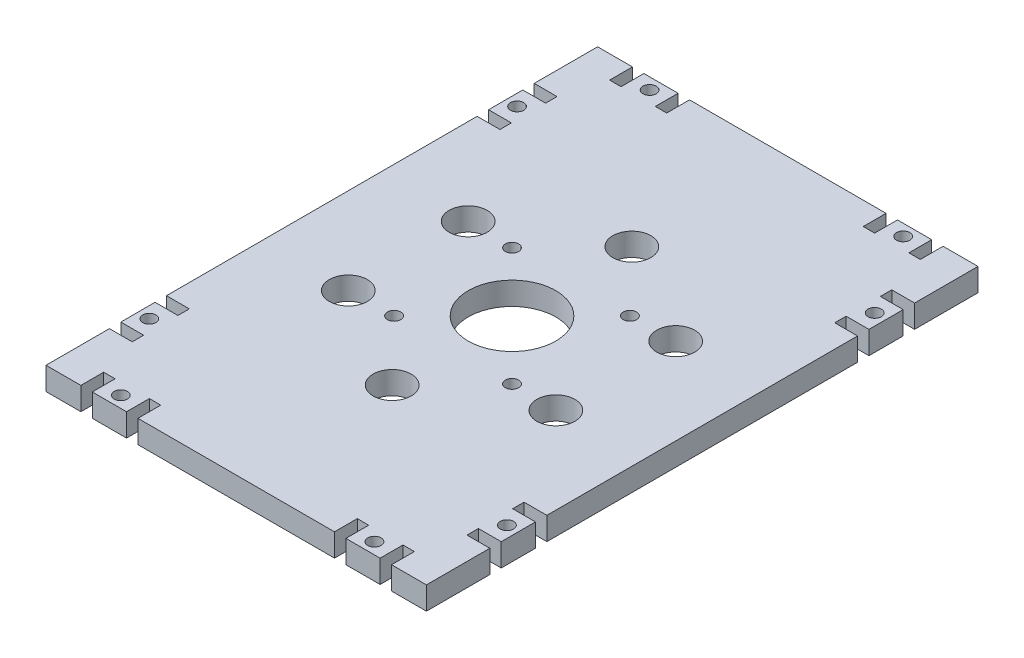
ISO-10303-21;
HEADER;
FILE_DESCRIPTION(('STEP AP214'),'2;1');
FILE_NAME('part.step','',(''),(''),'','','');
FILE_SCHEMA(('AUTOMOTIVE_DESIGN { 1 0 10303 214 1 1 1 1 }'));
ENDSEC;
DATA;
#1=APPLICATION_CONTEXT('core data for automotive mechanical design processes');
#2=APPLICATION_PROTOCOL_DEFINITION('international standard','automotive_design',2000,#1);
#3=PRODUCT_CONTEXT('',#1,'mechanical');
#4=PRODUCT('Part','Part','',(#3));
#5=PRODUCT_RELATED_PRODUCT_CATEGORY('part','',(#4));
#6=PRODUCT_DEFINITION_FORMATION('','',#4);
#7=PRODUCT_DEFINITION_CONTEXT('part definition',#1,'design');
#8=PRODUCT_DEFINITION('design','',#6,#7);
#9=PRODUCT_DEFINITION_SHAPE('','',#8);
#10=(LENGTH_UNIT() NAMED_UNIT(*) SI_UNIT(.MILLI.,.METRE.));
#11=(NAMED_UNIT(*) PLANE_ANGLE_UNIT() SI_UNIT($,.RADIAN.));
#12=(NAMED_UNIT(*) SI_UNIT($,.STERADIAN.) SOLID_ANGLE_UNIT());
#13=UNCERTAINTY_MEASURE_WITH_UNIT(LENGTH_MEASURE(1.E-05),#10,'distance_accuracy_value','');
#14=(GEOMETRIC_REPRESENTATION_CONTEXT(3) GLOBAL_UNCERTAINTY_ASSIGNED_CONTEXT((#13)) GLOBAL_UNIT_ASSIGNED_CONTEXT((#10,
#11,#12)) REPRESENTATION_CONTEXT('',''));
#15=CARTESIAN_POINT('',(0.,0.,0.));
#16=DIRECTION('',(0.,0.,1.));
#17=DIRECTION('',(1.,0.,0.));
#18=AXIS2_PLACEMENT_3D('',#15,#16,#17);
#19=CARTESIAN_POINT('',(50.,6.,72.5));
#20=DIRECTION('',(-1.,0.,0.));
#21=DIRECTION('',(0.,0.,1.));
#22=AXIS2_PLACEMENT_3D('',#19,#20,#21);
#23=PLANE('',#22);
#24=DIRECTION('',(0.,0.,-1.));
#25=VECTOR('',#24,1.);
#26=CARTESIAN_POINT('',(50.,0.,72.5));
#27=LINE('',#26,#25);
#28=CARTESIAN_POINT('',(50.,0.,72.5));
#29=VERTEX_POINT('',#28);
#30=CARTESIAN_POINT('',(50.,0.,55.8333333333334));
#31=VERTEX_POINT('',#30);
#32=EDGE_CURVE('E923',#29,#31,#27,.T.);
#33=ORIENTED_EDGE('',*,*,#32,.T.);
#34=DIRECTION('',(0.,1.,0.));
#35=VECTOR('',#34,1.);
#36=CARTESIAN_POINT('',(50.,0.,55.8333333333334));
#37=LINE('',#36,#35);
#38=CARTESIAN_POINT('',(50.,6.,55.8333333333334));
#39=VERTEX_POINT('',#38);
#40=EDGE_CURVE('E690',#31,#39,#37,.T.);
#41=ORIENTED_EDGE('',*,*,#40,.T.);
#42=DIRECTION('',(0.,0.,-1.));
#43=VECTOR('',#42,1.);
#44=CARTESIAN_POINT('',(50.,6.,72.5));
#45=LINE('',#44,#43);
#46=CARTESIAN_POINT('',(50.,6.,72.5));
#47=VERTEX_POINT('',#46);
#48=EDGE_CURVE('E903',#47,#39,#45,.T.);
#49=ORIENTED_EDGE('',*,*,#48,.F.);
#50=DIRECTION('',(0.,-1.,0.));
#51=VECTOR('',#50,1.);
#52=CARTESIAN_POINT('',(50.,6.,72.5));
#53=LINE('',#52,#51);
#54=EDGE_CURVE('E921',#47,#29,#53,.T.);
#55=ORIENTED_EDGE('',*,*,#54,.T.);
#56=EDGE_LOOP('',(#33,#41,#49,#55));
#57=FACE_BOUND('',#56,.T.);
#58=ADVANCED_FACE('F36',(#57),#23,.F.);
#59=CARTESIAN_POINT('',(50.,6.,52.8333333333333));
#60=VERTEX_POINT('',#59);
#61=CARTESIAN_POINT('',(50.,6.,43.8333333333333));
#62=VERTEX_POINT('',#61);
#63=EDGE_CURVE('E907',#60,#62,#45,.T.);
#64=ORIENTED_EDGE('',*,*,#63,.F.);
#65=DIRECTION('',(0.,1.,0.));
#66=VECTOR('',#65,1.);
#67=CARTESIAN_POINT('',(50.,0.,52.8333333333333));
#68=LINE('',#67,#66);
#69=CARTESIAN_POINT('',(50.,0.,52.8333333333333));
#70=VERTEX_POINT('',#69);
#71=EDGE_CURVE('E702',#70,#60,#68,.T.);
#72=ORIENTED_EDGE('',*,*,#71,.F.);
#73=CARTESIAN_POINT('',(50.,0.,43.8333333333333));
#74=VERTEX_POINT('',#73);
#75=EDGE_CURVE('E925',#70,#74,#27,.T.);
#76=ORIENTED_EDGE('',*,*,#75,.T.);
#77=DIRECTION('',(0.,1.,0.));
#78=VECTOR('',#77,1.);
#79=CARTESIAN_POINT('',(50.,0.,43.8333333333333));
#80=LINE('',#79,#78);
#81=EDGE_CURVE('E607',#74,#62,#80,.T.);
#82=ORIENTED_EDGE('',*,*,#81,.T.);
#83=EDGE_LOOP('',(#64,#72,#76,#82));
#84=FACE_BOUND('',#83,.T.);
#85=ADVANCED_FACE('F1056',(#84),#23,.F.);
#86=CARTESIAN_POINT('',(50.,0.,-43.8333333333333));
#87=VERTEX_POINT('',#86);
#88=CARTESIAN_POINT('',(50.,0.,-52.8333333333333));
#89=VERTEX_POINT('',#88);
#90=EDGE_CURVE('E932',#87,#89,#27,.T.);
#91=ORIENTED_EDGE('',*,*,#90,.T.);
#92=DIRECTION('',(0.,1.,0.));
#93=VECTOR('',#92,1.);
#94=CARTESIAN_POINT('',(50.,0.,-52.8333333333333));
#95=LINE('',#94,#93);
#96=CARTESIAN_POINT('',(50.,6.,-52.8333333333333));
#97=VERTEX_POINT('',#96);
#98=EDGE_CURVE('E749',#89,#97,#95,.T.);
#99=ORIENTED_EDGE('',*,*,#98,.T.);
#100=CARTESIAN_POINT('',(50.,6.,-43.8333333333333));
#101=VERTEX_POINT('',#100);
#102=EDGE_CURVE('E961',#101,#97,#45,.T.);
#103=ORIENTED_EDGE('',*,*,#102,.F.);
#104=DIRECTION('',(0.,1.,0.));
#105=VECTOR('',#104,1.);
#106=CARTESIAN_POINT('',(50.,0.,-43.8333333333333));
#107=LINE('',#106,#105);
#108=EDGE_CURVE('E759',#87,#101,#107,.T.);
#109=ORIENTED_EDGE('',*,*,#108,.F.);
#110=EDGE_LOOP('',(#91,#99,#103,#109));
#111=FACE_BOUND('',#110,.T.);
#112=ADVANCED_FACE('F1060',(#111),#23,.F.);
#113=CARTESIAN_POINT('',(50.,6.,40.8333333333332));
#114=VERTEX_POINT('',#113);
#115=CARTESIAN_POINT('',(50.,6.,-40.8333333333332));
#116=VERTEX_POINT('',#115);
#117=EDGE_CURVE('E959',#114,#116,#45,.T.);
#118=ORIENTED_EDGE('',*,*,#117,.F.);
#119=DIRECTION('',(0.,1.,0.));
#120=VECTOR('',#119,1.);
#121=CARTESIAN_POINT('',(50.,0.,40.8333333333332));
#122=LINE('',#121,#120);
#123=CARTESIAN_POINT('',(50.,0.,40.8333333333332));
#124=VERTEX_POINT('',#123);
#125=EDGE_CURVE('E630',#124,#114,#122,.T.);
#126=ORIENTED_EDGE('',*,*,#125,.F.);
#127=CARTESIAN_POINT('',(50.,0.,-40.8333333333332));
#128=VERTEX_POINT('',#127);
#129=EDGE_CURVE('E931',#124,#128,#27,.T.);
#130=ORIENTED_EDGE('',*,*,#129,.T.);
#131=DIRECTION('',(0.,1.,0.));
#132=VECTOR('',#131,1.);
#133=CARTESIAN_POINT('',(50.,0.,-40.8333333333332));
#134=LINE('',#133,#132);
#135=EDGE_CURVE('E745',#128,#116,#134,.T.);
#136=ORIENTED_EDGE('',*,*,#135,.T.);
#137=EDGE_LOOP('',(#118,#126,#130,#136));
#138=FACE_BOUND('',#137,.T.);
#139=ADVANCED_FACE('F947',(#138),#23,.F.);
#140=CARTESIAN_POINT('',(-50.,6.,-72.5));
#141=DIRECTION('',(0.,0.,1.));
#142=DIRECTION('',(1.,0.,0.));
#143=AXIS2_PLACEMENT_3D('',#140,#141,#142);
#144=PLANE('',#143);
#145=DIRECTION('',(-1.,0.,0.));
#146=VECTOR('',#145,1.);
#147=CARTESIAN_POINT('',(-50.,0.,-72.5));
#148=LINE('',#147,#146);
#149=CARTESIAN_POINT('',(50.,0.,-72.5));
#150=VERTEX_POINT('',#149);
#151=CARTESIAN_POINT('',(40.8333333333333,0.,-72.5));
#152=VERTEX_POINT('',#151);
#153=EDGE_CURVE('E491',#150,#152,#148,.T.);
#154=ORIENTED_EDGE('',*,*,#153,.T.);
#155=DIRECTION('',(0.,1.,0.));
#156=VECTOR('',#155,1.);
#157=CARTESIAN_POINT('',(40.8333333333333,0.,-72.5));
#158=LINE('',#157,#156);
#159=CARTESIAN_POINT('',(40.8333333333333,6.,-72.5));
#160=VERTEX_POINT('',#159);
#161=EDGE_CURVE('E654',#152,#160,#158,.T.);
#162=ORIENTED_EDGE('',*,*,#161,.T.);
#163=DIRECTION('',(-1.,0.,0.));
#164=VECTOR('',#163,1.);
#165=CARTESIAN_POINT('',(-50.,6.,-72.5));
#166=LINE('',#165,#164);
#167=CARTESIAN_POINT('',(50.,6.,-72.5));
#168=VERTEX_POINT('',#167);
#169=EDGE_CURVE('E909',#168,#160,#166,.T.);
#170=ORIENTED_EDGE('',*,*,#169,.F.);
#171=DIRECTION('',(0.,-1.,0.));
#172=VECTOR('',#171,1.);
#173=CARTESIAN_POINT('',(50.,6.,-72.5));
#174=LINE('',#173,#172);
#175=EDGE_CURVE('E11',#168,#150,#174,.T.);
#176=ORIENTED_EDGE('',*,*,#175,.T.);
#177=EDGE_LOOP('',(#154,#162,#170,#176));
#178=FACE_BOUND('',#177,.T.);
#179=ADVANCED_FACE('F1053',(#178),#144,.F.);
#180=CARTESIAN_POINT('',(25.8333333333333,6.,-72.5));
#181=VERTEX_POINT('',#180);
#182=CARTESIAN_POINT('',(-25.8333333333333,6.,-72.5));
#183=VERTEX_POINT('',#182);
#184=EDGE_CURVE('E993',#181,#183,#166,.T.);
#185=ORIENTED_EDGE('',*,*,#184,.F.);
#186=DIRECTION('',(0.,1.,0.));
#187=VECTOR('',#186,1.);
#188=CARTESIAN_POINT('',(25.8333333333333,0.,-72.5));
#189=LINE('',#188,#187);
#190=CARTESIAN_POINT('',(25.8333333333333,0.,-72.5));
#191=VERTEX_POINT('',#190);
#192=EDGE_CURVE('E614',#191,#181,#189,.T.);
#193=ORIENTED_EDGE('',*,*,#192,.F.);
#194=CARTESIAN_POINT('',(-25.8333333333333,0.,-72.5));
#195=VERTEX_POINT('',#194);
#196=EDGE_CURVE('E1024',#191,#195,#148,.T.);
#197=ORIENTED_EDGE('',*,*,#196,.T.);
#198=DIRECTION('',(0.,1.,0.));
#199=VECTOR('',#198,1.);
#200=CARTESIAN_POINT('',(-25.8333333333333,0.,-72.5));
#201=LINE('',#200,#199);
#202=EDGE_CURVE('E883',#195,#183,#201,.T.);
#203=ORIENTED_EDGE('',*,*,#202,.T.);
#204=EDGE_LOOP('',(#185,#193,#197,#203));
#205=FACE_BOUND('',#204,.T.);
#206=ADVANCED_FACE('F1022',(#205),#144,.F.);
#207=CARTESIAN_POINT('',(-40.8333333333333,6.,-72.5));
#208=VERTEX_POINT('',#207);
#209=CARTESIAN_POINT('',(-50.,6.,-72.5));
#210=VERTEX_POINT('',#209);
#211=EDGE_CURVE('E906',#208,#210,#166,.T.);
#212=ORIENTED_EDGE('',*,*,#211,.F.);
#213=DIRECTION('',(0.,1.,0.));
#214=VECTOR('',#213,1.);
#215=CARTESIAN_POINT('',(-40.8333333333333,0.,-72.5));
#216=LINE('',#215,#214);
#217=CARTESIAN_POINT('',(-40.8333333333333,0.,-72.5));
#218=VERTEX_POINT('',#217);
#219=EDGE_CURVE('E837',#218,#208,#216,.T.);
#220=ORIENTED_EDGE('',*,*,#219,.F.);
#221=CARTESIAN_POINT('',(-50.,0.,-72.5));
#222=VERTEX_POINT('',#221);
#223=EDGE_CURVE('E499',#218,#222,#148,.T.);
#224=ORIENTED_EDGE('',*,*,#223,.T.);
#225=DIRECTION('',(0.,-1.,0.));
#226=VECTOR('',#225,1.);
#227=CARTESIAN_POINT('',(-50.,6.,-72.5));
#228=LINE('',#227,#226);
#229=EDGE_CURVE('E44',#210,#222,#228,.T.);
#230=ORIENTED_EDGE('',*,*,#229,.F.);
#231=EDGE_LOOP('',(#212,#220,#224,#230));
#232=FACE_BOUND('',#231,.T.);
#233=ADVANCED_FACE('F1047',(#232),#144,.F.);
#234=CARTESIAN_POINT('',(37.8333333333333,6.,-72.5));
#235=VERTEX_POINT('',#234);
#236=CARTESIAN_POINT('',(28.8333333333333,6.,-72.5));
#237=VERTEX_POINT('',#236);
#238=EDGE_CURVE('E912',#235,#237,#166,.T.);
#239=ORIENTED_EDGE('',*,*,#238,.F.);
#240=DIRECTION('',(0.,1.,0.));
#241=VECTOR('',#240,1.);
#242=CARTESIAN_POINT('',(37.8333333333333,0.,-72.5));
#243=LINE('',#242,#241);
#244=CARTESIAN_POINT('',(37.8333333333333,0.,-72.5));
#245=VERTEX_POINT('',#244);
#246=EDGE_CURVE('E668',#245,#235,#243,.T.);
#247=ORIENTED_EDGE('',*,*,#246,.F.);
#248=CARTESIAN_POINT('',(28.8333333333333,0.,-72.5));
#249=VERTEX_POINT('',#248);
#250=EDGE_CURVE('E497',#245,#249,#148,.T.);
#251=ORIENTED_EDGE('',*,*,#250,.T.);
#252=DIRECTION('',(0.,1.,0.));
#253=VECTOR('',#252,1.);
#254=CARTESIAN_POINT('',(28.8333333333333,0.,-72.5));
#255=LINE('',#254,#253);
#256=EDGE_CURVE('E616',#249,#237,#255,.T.);
#257=ORIENTED_EDGE('',*,*,#256,.T.);
#258=EDGE_LOOP('',(#239,#247,#251,#257));
#259=FACE_BOUND('',#258,.T.);
#260=ADVANCED_FACE('F1009',(#259),#144,.F.);
#261=CARTESIAN_POINT('',(-50.,6.,72.5));
#262=DIRECTION('',(1.,0.,0.));
#263=DIRECTION('',(0.,0.,-1.));
#264=AXIS2_PLACEMENT_3D('',#261,#262,#263);
#265=PLANE('',#264);
#266=DIRECTION('',(0.,0.,1.));
#267=VECTOR('',#266,1.);
#268=CARTESIAN_POINT('',(-50.,0.,72.5));
#269=LINE('',#268,#267);
#270=CARTESIAN_POINT('',(-50.,0.,-55.8333333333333));
#271=VERTEX_POINT('',#270);
#272=EDGE_CURVE('E493',#222,#271,#269,.T.);
#273=ORIENTED_EDGE('',*,*,#272,.T.);
#274=DIRECTION('',(0.,1.,0.));
#275=VECTOR('',#274,1.);
#276=CARTESIAN_POINT('',(-50.,0.,-55.8333333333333));
#277=LINE('',#276,#275);
#278=CARTESIAN_POINT('',(-50.,6.,-55.8333333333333));
#279=VERTEX_POINT('',#278);
#280=EDGE_CURVE('E821',#271,#279,#277,.T.);
#281=ORIENTED_EDGE('',*,*,#280,.T.);
#282=DIRECTION('',(0.,0.,1.));
#283=VECTOR('',#282,1.);
#284=CARTESIAN_POINT('',(-50.,6.,72.5));
#285=LINE('',#284,#283);
#286=EDGE_CURVE('E913',#210,#279,#285,.T.);
#287=ORIENTED_EDGE('',*,*,#286,.F.);
#288=ORIENTED_EDGE('',*,*,#229,.T.);
#289=EDGE_LOOP('',(#273,#281,#287,#288));
#290=FACE_BOUND('',#289,.T.);
#291=ADVANCED_FACE('F979',(#290),#265,.F.);
#292=CARTESIAN_POINT('',(-50.,6.,-52.8333333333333));
#293=VERTEX_POINT('',#292);
#294=CARTESIAN_POINT('',(-50.,6.,-43.8333333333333));
#295=VERTEX_POINT('',#294);
#296=EDGE_CURVE('E917',#293,#295,#285,.T.);
#297=ORIENTED_EDGE('',*,*,#296,.F.);
#298=DIRECTION('',(0.,1.,0.));
#299=VECTOR('',#298,1.);
#300=CARTESIAN_POINT('',(-50.,0.,-52.8333333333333));
#301=LINE('',#300,#299);
#302=CARTESIAN_POINT('',(-50.,0.,-52.8333333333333));
#303=VERTEX_POINT('',#302);
#304=EDGE_CURVE('E832',#303,#293,#301,.T.);
#305=ORIENTED_EDGE('',*,*,#304,.F.);
#306=CARTESIAN_POINT('',(-50.,0.,-43.8333333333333));
#307=VERTEX_POINT('',#306);
#308=EDGE_CURVE('E503',#303,#307,#269,.T.);
#309=ORIENTED_EDGE('',*,*,#308,.T.);
#310=DIRECTION('',(0.,1.,0.));
#311=VECTOR('',#310,1.);
#312=CARTESIAN_POINT('',(-50.,0.,-43.8333333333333));
#313=LINE('',#312,#311);
#314=EDGE_CURVE('E802',#307,#295,#313,.T.);
#315=ORIENTED_EDGE('',*,*,#314,.T.);
#316=EDGE_LOOP('',(#297,#305,#309,#315));
#317=FACE_BOUND('',#316,.T.);
#318=ADVANCED_FACE('F1815',(#317),#265,.F.);
#319=CARTESIAN_POINT('',(-50.,0.,43.8333333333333));
#320=VERTEX_POINT('',#319);
#321=CARTESIAN_POINT('',(-50.,0.,52.8333333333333));
#322=VERTEX_POINT('',#321);
#323=EDGE_CURVE('E490',#320,#322,#269,.T.);
#324=ORIENTED_EDGE('',*,*,#323,.T.);
#325=DIRECTION('',(0.,1.,0.));
#326=VECTOR('',#325,1.);
#327=CARTESIAN_POINT('',(-50.,0.,52.8333333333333));
#328=LINE('',#327,#326);
#329=CARTESIAN_POINT('',(-50.,6.,52.8333333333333));
#330=VERTEX_POINT('',#329);
#331=EDGE_CURVE('E548',#322,#330,#328,.T.);
#332=ORIENTED_EDGE('',*,*,#331,.T.);
#333=CARTESIAN_POINT('',(-50.,6.,43.8333333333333));
#334=VERTEX_POINT('',#333);
#335=EDGE_CURVE('E1866',#334,#330,#285,.T.);
#336=ORIENTED_EDGE('',*,*,#335,.F.);
#337=DIRECTION('',(0.,1.,0.));
#338=VECTOR('',#337,1.);
#339=CARTESIAN_POINT('',(-50.,0.,43.8333333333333));
#340=LINE('',#339,#338);
#341=EDGE_CURVE('E555',#320,#334,#340,.T.);
#342=ORIENTED_EDGE('',*,*,#341,.F.);
#343=EDGE_LOOP('',(#324,#332,#336,#342));
#344=FACE_BOUND('',#343,.T.);
#345=ADVANCED_FACE('F1807',(#344),#265,.F.);
#346=CARTESIAN_POINT('',(-50.,6.,-40.8333333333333));
#347=VERTEX_POINT('',#346);
#348=CARTESIAN_POINT('',(-50.,6.,40.8333333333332));
#349=VERTEX_POINT('',#348);
#350=EDGE_CURVE('E1865',#347,#349,#285,.T.);
#351=ORIENTED_EDGE('',*,*,#350,.F.);
#352=DIRECTION('',(0.,1.,0.));
#353=VECTOR('',#352,1.);
#354=CARTESIAN_POINT('',(-50.,0.,-40.8333333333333));
#355=LINE('',#354,#353);
#356=CARTESIAN_POINT('',(-50.,0.,-40.8333333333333));
#357=VERTEX_POINT('',#356);
#358=EDGE_CURVE('E523',#357,#347,#355,.T.);
#359=ORIENTED_EDGE('',*,*,#358,.F.);
#360=CARTESIAN_POINT('',(-50.,0.,40.8333333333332));
#361=VERTEX_POINT('',#360);
#362=EDGE_CURVE('E495',#357,#361,#269,.T.);
#363=ORIENTED_EDGE('',*,*,#362,.T.);
#364=DIRECTION('',(0.,1.,0.));
#365=VECTOR('',#364,1.);
#366=CARTESIAN_POINT('',(-50.,0.,40.8333333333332));
#367=LINE('',#366,#365);
#368=EDGE_CURVE('E521',#361,#349,#367,.T.);
#369=ORIENTED_EDGE('',*,*,#368,.T.);
#370=EDGE_LOOP('',(#351,#359,#363,#369));
#371=FACE_BOUND('',#370,.T.);
#372=ADVANCED_FACE('F520',(#371),#265,.F.);
#373=CARTESIAN_POINT('',(-50.,6.,72.5));
#374=DIRECTION('',(0.,0.,-1.));
#375=DIRECTION('',(-1.,0.,0.));
#376=AXIS2_PLACEMENT_3D('',#373,#374,#375);
#377=PLANE('',#376);
#378=DIRECTION('',(1.,0.,0.));
#379=VECTOR('',#378,1.);
#380=CARTESIAN_POINT('',(-50.,6.,72.5));
#381=LINE('',#380,#379);
#382=CARTESIAN_POINT('',(40.8333333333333,6.,72.4999999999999));
#383=VERTEX_POINT('',#382);
#384=EDGE_CURVE('E916',#383,#47,#381,.T.);
#385=ORIENTED_EDGE('',*,*,#384,.F.);
#386=DIRECTION('',(0.,1.,0.));
#387=VECTOR('',#386,1.);
#388=CARTESIAN_POINT('',(40.8333333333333,0.,72.4999999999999));
#389=LINE('',#388,#387);
#390=CARTESIAN_POINT('',(40.8333333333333,0.,72.4999999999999));
#391=VERTEX_POINT('',#390);
#392=EDGE_CURVE('E725',#391,#383,#389,.T.);
#393=ORIENTED_EDGE('',*,*,#392,.F.);
#394=DIRECTION('',(1.,0.,0.));
#395=VECTOR('',#394,1.);
#396=CARTESIAN_POINT('',(-50.,0.,72.5));
#397=LINE('',#396,#395);
#398=EDGE_CURVE('E502',#391,#29,#397,.T.);
#399=ORIENTED_EDGE('',*,*,#398,.T.);
#400=ORIENTED_EDGE('',*,*,#54,.F.);
#401=EDGE_LOOP('',(#385,#393,#399,#400));
#402=FACE_BOUND('',#401,.T.);
#403=ADVANCED_FACE('F1755',(#402),#377,.F.);
#404=CARTESIAN_POINT('',(-25.8333333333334,6.,72.5));
#405=VERTEX_POINT('',#404);
#406=CARTESIAN_POINT('',(25.8333333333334,6.,72.5));
#407=VERTEX_POINT('',#406);
#408=EDGE_CURVE('E1940',#405,#407,#381,.T.);
#409=ORIENTED_EDGE('',*,*,#408,.F.);
#410=DIRECTION('',(0.,1.,0.));
#411=VECTOR('',#410,1.);
#412=CARTESIAN_POINT('',(-25.8333333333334,0.,72.5));
#413=LINE('',#412,#411);
#414=CARTESIAN_POINT('',(-25.8333333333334,0.,72.5));
#415=VERTEX_POINT('',#414);
#416=EDGE_CURVE('E1911',#415,#405,#413,.T.);
#417=ORIENTED_EDGE('',*,*,#416,.F.);
#418=CARTESIAN_POINT('',(25.8333333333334,0.,72.5));
#419=VERTEX_POINT('',#418);
#420=EDGE_CURVE('E973',#415,#419,#397,.T.);
#421=ORIENTED_EDGE('',*,*,#420,.T.);
#422=DIRECTION('',(0.,1.,0.));
#423=VECTOR('',#422,1.);
#424=CARTESIAN_POINT('',(25.8333333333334,0.,72.5));
#425=LINE('',#424,#423);
#426=EDGE_CURVE('E568',#419,#407,#425,.T.);
#427=ORIENTED_EDGE('',*,*,#426,.T.);
#428=EDGE_LOOP('',(#409,#417,#421,#427));
#429=FACE_BOUND('',#428,.T.);
#430=ADVANCED_FACE('F1783',(#429),#377,.F.);
#431=CARTESIAN_POINT('',(-50.,0.,72.5));
#432=VERTEX_POINT('',#431);
#433=CARTESIAN_POINT('',(-40.8333333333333,0.,72.5));
#434=VERTEX_POINT('',#433);
#435=EDGE_CURVE('E489',#432,#434,#397,.T.);
#436=ORIENTED_EDGE('',*,*,#435,.T.);
#437=DIRECTION('',(0.,1.,0.));
#438=VECTOR('',#437,1.);
#439=CARTESIAN_POINT('',(-40.8333333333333,0.,72.5));
#440=LINE('',#439,#438);
#441=CARTESIAN_POINT('',(-40.8333333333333,6.,72.5));
#442=VERTEX_POINT('',#441);
#443=EDGE_CURVE('E1877',#434,#442,#440,.T.);
#444=ORIENTED_EDGE('',*,*,#443,.T.);
#445=CARTESIAN_POINT('',(-50.,6.,72.5));
#446=VERTEX_POINT('',#445);
#447=EDGE_CURVE('E918',#446,#442,#381,.T.);
#448=ORIENTED_EDGE('',*,*,#447,.F.);
#449=DIRECTION('',(0.,-1.,0.));
#450=VECTOR('',#449,1.);
#451=CARTESIAN_POINT('',(-50.,6.,72.5));
#452=LINE('',#451,#450);
#453=EDGE_CURVE('E976',#446,#432,#452,.T.);
#454=ORIENTED_EDGE('',*,*,#453,.T.);
#455=EDGE_LOOP('',(#436,#444,#448,#454));
#456=FACE_BOUND('',#455,.T.);
#457=ADVANCED_FACE('F1068',(#456),#377,.F.);
#458=CARTESIAN_POINT('',(-37.8333333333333,0.,72.5));
#459=VERTEX_POINT('',#458);
#460=CARTESIAN_POINT('',(-28.8333333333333,0.,72.5));
#461=VERTEX_POINT('',#460);
#462=EDGE_CURVE('E969',#459,#461,#397,.T.);
#463=ORIENTED_EDGE('',*,*,#462,.T.);
#464=DIRECTION('',(0.,1.,0.));
#465=VECTOR('',#464,1.);
#466=CARTESIAN_POINT('',(-28.8333333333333,0.,72.5));
#467=LINE('',#466,#465);
#468=CARTESIAN_POINT('',(-28.8333333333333,6.,72.5));
#469=VERTEX_POINT('',#468);
#470=EDGE_CURVE('E1913',#461,#469,#467,.T.);
#471=ORIENTED_EDGE('',*,*,#470,.T.);
#472=CARTESIAN_POINT('',(-37.8333333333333,6.,72.5));
#473=VERTEX_POINT('',#472);
#474=EDGE_CURVE('E922',#473,#469,#381,.T.);
#475=ORIENTED_EDGE('',*,*,#474,.F.);
#476=DIRECTION('',(0.,1.,0.));
#477=VECTOR('',#476,1.);
#478=CARTESIAN_POINT('',(-37.8333333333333,0.,72.5));
#479=LINE('',#478,#477);
#480=EDGE_CURVE('E1879',#459,#473,#479,.T.);
#481=ORIENTED_EDGE('',*,*,#480,.F.);
#482=EDGE_LOOP('',(#463,#471,#475,#481));
#483=FACE_BOUND('',#482,.T.);
#484=ADVANCED_FACE('F1063',(#483),#377,.F.);
#485=CARTESIAN_POINT('',(50.,6.,-55.8333333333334));
#486=VERTEX_POINT('',#485);
#487=EDGE_CURVE('E908',#486,#168,#45,.T.);
#488=ORIENTED_EDGE('',*,*,#487,.F.);
#489=DIRECTION('',(0.,1.,0.));
#490=VECTOR('',#489,1.);
#491=CARTESIAN_POINT('',(50.,0.,-55.8333333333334));
#492=LINE('',#491,#490);
#493=CARTESIAN_POINT('',(50.,0.,-55.8333333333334));
#494=VERTEX_POINT('',#493);
#495=EDGE_CURVE('E773',#494,#486,#492,.T.);
#496=ORIENTED_EDGE('',*,*,#495,.F.);
#497=EDGE_CURVE('E900',#494,#150,#27,.T.);
#498=ORIENTED_EDGE('',*,*,#497,.T.);
#499=ORIENTED_EDGE('',*,*,#175,.F.);
#500=EDGE_LOOP('',(#488,#496,#498,#499));
#501=FACE_BOUND('',#500,.T.);
#502=ADVANCED_FACE('F38',(#501),#23,.F.);
#503=CARTESIAN_POINT('',(-28.8333333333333,0.,-72.5));
#504=VERTEX_POINT('',#503);
#505=CARTESIAN_POINT('',(-37.8333333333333,0.,-72.5));
#506=VERTEX_POINT('',#505);
#507=EDGE_CURVE('E929',#504,#506,#148,.T.);
#508=ORIENTED_EDGE('',*,*,#507,.T.);
#509=DIRECTION('',(0.,1.,0.));
#510=VECTOR('',#509,1.);
#511=CARTESIAN_POINT('',(-37.8333333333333,0.,-72.5));
#512=LINE('',#511,#510);
#513=CARTESIAN_POINT('',(-37.8333333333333,6.,-72.5));
#514=VERTEX_POINT('',#513);
#515=EDGE_CURVE('E867',#506,#514,#512,.T.);
#516=ORIENTED_EDGE('',*,*,#515,.T.);
#517=CARTESIAN_POINT('',(-28.8333333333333,6.,-72.5));
#518=VERTEX_POINT('',#517);
#519=EDGE_CURVE('E991',#518,#514,#166,.T.);
#520=ORIENTED_EDGE('',*,*,#519,.F.);
#521=DIRECTION('',(0.,1.,0.));
#522=VECTOR('',#521,1.);
#523=CARTESIAN_POINT('',(-28.8333333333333,0.,-72.5));
#524=LINE('',#523,#522);
#525=EDGE_CURVE('E893',#504,#518,#524,.T.);
#526=ORIENTED_EDGE('',*,*,#525,.F.);
#527=EDGE_LOOP('',(#508,#516,#520,#526));
#528=FACE_BOUND('',#527,.T.);
#529=ADVANCED_FACE('F1038',(#528),#144,.F.);
#530=CARTESIAN_POINT('',(-50.,6.,55.8333333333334));
#531=VERTEX_POINT('',#530);
#532=EDGE_CURVE('E480',#531,#446,#285,.T.);
#533=ORIENTED_EDGE('',*,*,#532,.F.);
#534=DIRECTION('',(0.,1.,0.));
#535=VECTOR('',#534,1.);
#536=CARTESIAN_POINT('',(-50.,0.,55.8333333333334));
#537=LINE('',#536,#535);
#538=CARTESIAN_POINT('',(-50.,0.,55.8333333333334));
#539=VERTEX_POINT('',#538);
#540=EDGE_CURVE('E465',#539,#531,#537,.T.);
#541=ORIENTED_EDGE('',*,*,#540,.F.);
#542=EDGE_CURVE('E478',#539,#432,#269,.T.);
#543=ORIENTED_EDGE('',*,*,#542,.T.);
#544=ORIENTED_EDGE('',*,*,#453,.F.);
#545=EDGE_LOOP('',(#533,#541,#543,#544));
#546=FACE_BOUND('',#545,.T.);
#547=ADVANCED_FACE('F476',(#546),#265,.F.);
#548=CARTESIAN_POINT('',(28.8333333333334,0.,72.4999999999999));
#549=VERTEX_POINT('',#548);
#550=CARTESIAN_POINT('',(37.8333333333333,0.,72.5));
#551=VERTEX_POINT('',#550);
#552=EDGE_CURVE('E508',#549,#551,#397,.T.);
#553=ORIENTED_EDGE('',*,*,#552,.T.);
#554=DIRECTION('',(0.,1.,0.));
#555=VECTOR('',#554,1.);
#556=CARTESIAN_POINT('',(37.8333333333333,0.,72.4999999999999));
#557=LINE('',#556,#555);
#558=CARTESIAN_POINT('',(37.8333333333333,6.,72.4999999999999));
#559=VERTEX_POINT('',#558);
#560=EDGE_CURVE('E727',#551,#559,#557,.T.);
#561=ORIENTED_EDGE('',*,*,#560,.T.);
#562=CARTESIAN_POINT('',(28.8333333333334,6.,72.4999999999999));
#563=VERTEX_POINT('',#562);
#564=EDGE_CURVE('E1942',#563,#559,#381,.T.);
#565=ORIENTED_EDGE('',*,*,#564,.F.);
#566=DIRECTION('',(0.,1.,0.));
#567=VECTOR('',#566,1.);
#568=CARTESIAN_POINT('',(28.8333333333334,0.,72.4999999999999));
#569=LINE('',#568,#567);
#570=EDGE_CURVE('E582',#549,#563,#569,.T.);
#571=ORIENTED_EDGE('',*,*,#570,.F.);
#572=EDGE_LOOP('',(#553,#561,#565,#571));
#573=FACE_BOUND('',#572,.T.);
#574=ADVANCED_FACE('F1071',(#573),#377,.F.);
#575=CARTESIAN_POINT('',(0.,6.,0.));
#576=DIRECTION('',(0.,-1.,0.));
#577=DIRECTION('',(0.,0.,-1.));
#578=AXIS2_PLACEMENT_3D('',#575,#576,#577);
#579=PLANE('',#578);
#580=CARTESIAN_POINT('',(0.,6.,-31.5));
#581=DIRECTION('',(0.,1.,0.));
#582=DIRECTION('',(0.,0.,1.));
#583=AXIS2_PLACEMENT_3D('',#580,#581,#582);
#584=CIRCLE('',#583,5.);
#585=CARTESIAN_POINT('',(0.,6.,-26.5));
#586=VERTEX_POINT('',#585);
#587=EDGE_CURVE('E2059',#586,#586,#584,.T.);
#588=ORIENTED_EDGE('',*,*,#587,.F.);
#589=EDGE_LOOP('',(#588));
#590=FACE_BOUND('',#589,.T.);
#591=CARTESIAN_POINT('',(-27.2798002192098,6.,-15.75));
#592=DIRECTION('',(0.,1.,0.));
#593=DIRECTION('',(0.,0.,1.));
#594=AXIS2_PLACEMENT_3D('',#591,#592,#593);
#595=CIRCLE('',#594,5.);
#596=CARTESIAN_POINT('',(-27.2798002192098,6.,-10.75));
#597=VERTEX_POINT('',#596);
#598=EDGE_CURVE('E2060',#597,#597,#595,.T.);
#599=ORIENTED_EDGE('',*,*,#598,.F.);
#600=EDGE_LOOP('',(#599));
#601=FACE_BOUND('',#600,.T.);
#602=CARTESIAN_POINT('',(-27.2798002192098,6.,15.75));
#603=DIRECTION('',(0.,1.,0.));
#604=DIRECTION('',(0.,0.,1.));
#605=AXIS2_PLACEMENT_3D('',#602,#603,#604);
#606=CIRCLE('',#605,5.);
#607=CARTESIAN_POINT('',(-27.2798002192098,6.,20.75));
#608=VERTEX_POINT('',#607);
#609=EDGE_CURVE('E2034',#608,#608,#606,.T.);
#610=ORIENTED_EDGE('',*,*,#609,.F.);
#611=EDGE_LOOP('',(#610));
#612=FACE_BOUND('',#611,.T.);
#613=CARTESIAN_POINT('',(0.,6.,31.5));
#614=DIRECTION('',(0.,1.,0.));
#615=DIRECTION('',(0.,0.,1.));
#616=AXIS2_PLACEMENT_3D('',#613,#614,#615);
#617=CIRCLE('',#616,5.);
#618=CARTESIAN_POINT('',(0.,6.,36.5));
#619=VERTEX_POINT('',#618);
#620=EDGE_CURVE('E2041',#619,#619,#617,.T.);
#621=ORIENTED_EDGE('',*,*,#620,.F.);
#622=EDGE_LOOP('',(#621));
#623=FACE_BOUND('',#622,.T.);
#624=CARTESIAN_POINT('',(27.2798002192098,6.,15.75));
#625=DIRECTION('',(0.,1.,0.));
#626=DIRECTION('',(0.,0.,1.));
#627=AXIS2_PLACEMENT_3D('',#624,#625,#626);
#628=CIRCLE('',#627,5.);
#629=CARTESIAN_POINT('',(27.2798002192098,6.,20.75));
#630=VERTEX_POINT('',#629);
#631=EDGE_CURVE('E2047',#630,#630,#628,.T.);
#632=ORIENTED_EDGE('',*,*,#631,.F.);
#633=EDGE_LOOP('',(#632));
#634=FACE_BOUND('',#633,.T.);
#635=CARTESIAN_POINT('',(27.2798002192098,6.,-15.75));
#636=DIRECTION('',(0.,1.,0.));
#637=DIRECTION('',(0.,0.,1.));
#638=AXIS2_PLACEMENT_3D('',#635,#636,#637);
#639=CIRCLE('',#638,5.);
#640=CARTESIAN_POINT('',(27.2798002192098,6.,-10.75));
#641=VERTEX_POINT('',#640);
#642=EDGE_CURVE('E2053',#641,#641,#639,.T.);
#643=ORIENTED_EDGE('',*,*,#642,.F.);
#644=EDGE_LOOP('',(#643));
#645=FACE_BOUND('',#644,.T.);
#646=CARTESIAN_POINT('',(15.5,6.,15.5));
#647=DIRECTION('',(0.,1.,0.));
#648=DIRECTION('',(0.,0.,-1.));
#649=AXIS2_PLACEMENT_3D('',#646,#647,#648);
#650=CIRCLE('',#649,1.75);
#651=CARTESIAN_POINT('',(15.5,6.,13.75));
#652=VERTEX_POINT('',#651);
#653=EDGE_CURVE('E2010',#652,#652,#650,.T.);
#654=ORIENTED_EDGE('',*,*,#653,.F.);
#655=EDGE_LOOP('',(#654));
#656=FACE_BOUND('',#655,.T.);
#657=CARTESIAN_POINT('',(-15.5,6.,15.5));
#658=DIRECTION('',(0.,1.,0.));
#659=DIRECTION('',(0.,0.,-1.));
#660=AXIS2_PLACEMENT_3D('',#657,#658,#659);
#661=CIRCLE('',#660,1.74999999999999);
#662=CARTESIAN_POINT('',(-15.5,6.,13.75));
#663=VERTEX_POINT('',#662);
#664=EDGE_CURVE('E2017',#663,#663,#661,.T.);
#665=ORIENTED_EDGE('',*,*,#664,.F.);
#666=EDGE_LOOP('',(#665));
#667=FACE_BOUND('',#666,.T.);
#668=CARTESIAN_POINT('',(-15.5,6.,-15.5));
#669=DIRECTION('',(0.,1.,0.));
#670=DIRECTION('',(0.,0.,1.));
#671=AXIS2_PLACEMENT_3D('',#668,#669,#670);
#672=CIRCLE('',#671,1.75);
#673=CARTESIAN_POINT('',(-15.5,6.,-13.75));
#674=VERTEX_POINT('',#673);
#675=EDGE_CURVE('E2023',#674,#674,#672,.T.);
#676=ORIENTED_EDGE('',*,*,#675,.F.);
#677=EDGE_LOOP('',(#676));
#678=FACE_BOUND('',#677,.T.);
#679=CARTESIAN_POINT('',(15.5,6.,-15.5));
#680=DIRECTION('',(0.,1.,0.));
#681=DIRECTION('',(0.,0.,1.));
#682=AXIS2_PLACEMENT_3D('',#679,#680,#681);
#683=CIRCLE('',#682,1.75);
#684=CARTESIAN_POINT('',(15.5,6.,-13.75));
#685=VERTEX_POINT('',#684);
#686=EDGE_CURVE('E2029',#685,#685,#683,.T.);
#687=ORIENTED_EDGE('',*,*,#686,.F.);
#688=EDGE_LOOP('',(#687));
#689=FACE_BOUND('',#688,.T.);
#690=CARTESIAN_POINT('',(0.,6.,0.));
#691=DIRECTION('',(0.,1.,0.));
#692=DIRECTION('',(0.,0.,1.));
#693=AXIS2_PLACEMENT_3D('',#690,#691,#692);
#694=CIRCLE('',#693,11.5);
#695=CARTESIAN_POINT('',(0.,6.,11.5));
#696=VERTEX_POINT('',#695);
#697=EDGE_CURVE('E2004',#696,#696,#694,.T.);
#698=ORIENTED_EDGE('',*,*,#697,.F.);
#699=EDGE_LOOP('',(#698));
#700=FACE_BOUND('',#699,.T.);
#701=CARTESIAN_POINT('',(33.3333333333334,6.,69.5));
#702=DIRECTION('',(0.,1.,0.));
#703=DIRECTION('',(0.,0.,1.));
#704=AXIS2_PLACEMENT_3D('',#701,#702,#703);
#705=CIRCLE('',#704,1.75);
#706=CARTESIAN_POINT('',(33.3333333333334,6.,71.25));
#707=VERTEX_POINT('',#706);
#708=EDGE_CURVE('E579',#707,#707,#705,.T.);
#709=ORIENTED_EDGE('',*,*,#708,.F.);
#710=EDGE_LOOP('',(#709));
#711=FACE_BOUND('',#710,.T.);
#712=CARTESIAN_POINT('',(47.,6.,48.3333333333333));
#713=DIRECTION('',(0.,1.,0.));
#714=DIRECTION('',(0.,0.,1.));
#715=AXIS2_PLACEMENT_3D('',#712,#713,#714);
#716=CIRCLE('',#715,1.75);
#717=CARTESIAN_POINT('',(47.,6.,50.0833333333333));
#718=VERTEX_POINT('',#717);
#719=EDGE_CURVE('E678',#718,#718,#716,.T.);
#720=ORIENTED_EDGE('',*,*,#719,.F.);
#721=EDGE_LOOP('',(#720));
#722=FACE_BOUND('',#721,.T.);
#723=CARTESIAN_POINT('',(33.3333333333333,6.,-69.5));
#724=DIRECTION('',(0.,1.,0.));
#725=DIRECTION('',(0.,0.,-1.));
#726=AXIS2_PLACEMENT_3D('',#723,#724,#725);
#727=CIRCLE('',#726,1.75);
#728=CARTESIAN_POINT('',(33.3333333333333,6.,-71.25));
#729=VERTEX_POINT('',#728);
#730=EDGE_CURVE('E613',#729,#729,#727,.T.);
#731=ORIENTED_EDGE('',*,*,#730,.F.);
#732=EDGE_LOOP('',(#731));
#733=FACE_BOUND('',#732,.T.);
#734=CARTESIAN_POINT('',(-47.,6.,-48.3333333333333));
#735=DIRECTION('',(0.,1.,0.));
#736=DIRECTION('',(0.,0.,1.));
#737=AXIS2_PLACEMENT_3D('',#734,#735,#736);
#738=CIRCLE('',#737,1.75);
#739=CARTESIAN_POINT('',(-47.,6.,-46.5833333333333));
#740=VERTEX_POINT('',#739);
#741=EDGE_CURVE('E818',#740,#740,#738,.T.);
#742=ORIENTED_EDGE('',*,*,#741,.F.);
#743=EDGE_LOOP('',(#742));
#744=FACE_BOUND('',#743,.T.);
#745=CARTESIAN_POINT('',(47.,6.,-48.3333333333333));
#746=DIRECTION('',(0.,1.,0.));
#747=DIRECTION('',(0.,0.,-1.));
#748=AXIS2_PLACEMENT_3D('',#745,#746,#747);
#749=CIRCLE('',#748,1.75);
#750=CARTESIAN_POINT('',(47.,6.,-50.0833333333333));
#751=VERTEX_POINT('',#750);
#752=EDGE_CURVE('E756',#751,#751,#749,.T.);
#753=ORIENTED_EDGE('',*,*,#752,.F.);
#754=EDGE_LOOP('',(#753));
#755=FACE_BOUND('',#754,.T.);
#756=CARTESIAN_POINT('',(-47.,6.,48.3333333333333));
#757=DIRECTION('',(0.,1.,0.));
#758=DIRECTION('',(0.,0.,-1.));
#759=AXIS2_PLACEMENT_3D('',#756,#757,#758);
#760=CIRCLE('',#759,1.75);
#761=CARTESIAN_POINT('',(-47.,6.,46.5833333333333));
#762=VERTEX_POINT('',#761);
#763=EDGE_CURVE('E588',#762,#762,#760,.T.);
#764=ORIENTED_EDGE('',*,*,#763,.F.);
#765=EDGE_LOOP('',(#764));
#766=FACE_BOUND('',#765,.T.);
#767=CARTESIAN_POINT('',(-33.3333333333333,6.,69.5));
#768=DIRECTION('',(0.,1.,0.));
#769=DIRECTION('',(0.,0.,-1.));
#770=AXIS2_PLACEMENT_3D('',#767,#768,#769);
#771=CIRCLE('',#770,1.75);
#772=CARTESIAN_POINT('',(-33.3333333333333,6.,67.75));
#773=VERTEX_POINT('',#772);
#774=EDGE_CURVE('E542',#773,#773,#771,.T.);
#775=ORIENTED_EDGE('',*,*,#774,.F.);
#776=EDGE_LOOP('',(#775));
#777=FACE_BOUND('',#776,.T.);
#778=CARTESIAN_POINT('',(-33.3333333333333,6.,-69.5));
#779=DIRECTION('',(0.,1.,0.));
#780=DIRECTION('',(0.,0.,1.));
#781=AXIS2_PLACEMENT_3D('',#778,#779,#780);
#782=CIRCLE('',#781,1.75);
#783=CARTESIAN_POINT('',(-33.3333333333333,6.,-67.75));
#784=VERTEX_POINT('',#783);
#785=EDGE_CURVE('E817',#784,#784,#782,.T.);
#786=ORIENTED_EDGE('',*,*,#785,.F.);
#787=EDGE_LOOP('',(#786));
#788=FACE_BOUND('',#787,.T.);
#789=DIRECTION('',(-1.,0.,0.));
#790=VECTOR('',#789,1.);
#791=CARTESIAN_POINT('',(40.8333333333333,6.,66.4999999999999));
#792=LINE('',#791,#790);
#793=CARTESIAN_POINT('',(40.8333333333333,6.,66.4999999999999));
#794=VERTEX_POINT('',#793);
#795=CARTESIAN_POINT('',(37.8333333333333,6.,66.4999999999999));
#796=VERTEX_POINT('',#795);
#797=EDGE_CURVE('E716',#794,#796,#792,.T.);
#798=ORIENTED_EDGE('',*,*,#797,.F.);
#799=DIRECTION('',(0.,0.,-1.));
#800=VECTOR('',#799,1.);
#801=CARTESIAN_POINT('',(40.8333333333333,6.,66.4999999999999));
#802=LINE('',#801,#800);
#803=EDGE_CURVE('E710',#383,#794,#802,.T.);
#804=ORIENTED_EDGE('',*,*,#803,.F.);
#805=ORIENTED_EDGE('',*,*,#384,.T.);
#806=ORIENTED_EDGE('',*,*,#48,.T.);
#807=DIRECTION('',(1.,0.,0.));
#808=VECTOR('',#807,1.);
#809=CARTESIAN_POINT('',(50.,6.,55.8333333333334));
#810=LINE('',#809,#808);
#811=CARTESIAN_POINT('',(44.,6.,55.8333333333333));
#812=VERTEX_POINT('',#811);
#813=EDGE_CURVE('E691',#812,#39,#810,.T.);
#814=ORIENTED_EDGE('',*,*,#813,.F.);
#815=DIRECTION('',(0.,0.,1.));
#816=VECTOR('',#815,1.);
#817=CARTESIAN_POINT('',(44.,6.,55.8333333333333));
#818=LINE('',#817,#816);
#819=CARTESIAN_POINT('',(44.,6.,52.8333333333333));
#820=VERTEX_POINT('',#819);
#821=EDGE_CURVE('E686',#820,#812,#818,.T.);
#822=ORIENTED_EDGE('',*,*,#821,.F.);
#823=DIRECTION('',(-1.,0.,0.));
#824=VECTOR('',#823,1.);
#825=CARTESIAN_POINT('',(50.,6.,52.8333333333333));
#826=LINE('',#825,#824);
#827=EDGE_CURVE('E693',#60,#820,#826,.T.);
#828=ORIENTED_EDGE('',*,*,#827,.F.);
#829=ORIENTED_EDGE('',*,*,#63,.T.);
#830=DIRECTION('',(1.,0.,0.));
#831=VECTOR('',#830,1.);
#832=CARTESIAN_POINT('',(50.,6.,43.8333333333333));
#833=LINE('',#832,#831);
#834=CARTESIAN_POINT('',(44.,6.,43.8333333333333));
#835=VERTEX_POINT('',#834);
#836=EDGE_CURVE('E624',#835,#62,#833,.T.);
#837=ORIENTED_EDGE('',*,*,#836,.F.);
#838=DIRECTION('',(0.,0.,1.));
#839=VECTOR('',#838,1.);
#840=CARTESIAN_POINT('',(44.,6.,40.8333333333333));
#841=LINE('',#840,#839);
#842=CARTESIAN_POINT('',(44.,6.,40.8333333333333));
#843=VERTEX_POINT('',#842);
#844=EDGE_CURVE('E634',#843,#835,#841,.T.);
#845=ORIENTED_EDGE('',*,*,#844,.F.);
#846=DIRECTION('',(-1.,0.,0.));
#847=VECTOR('',#846,1.);
#848=CARTESIAN_POINT('',(50.,6.,40.8333333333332));
#849=LINE('',#848,#847);
#850=EDGE_CURVE('E631',#114,#843,#849,.T.);
#851=ORIENTED_EDGE('',*,*,#850,.F.);
#852=ORIENTED_EDGE('',*,*,#117,.T.);
#853=DIRECTION('',(1.,0.,0.));
#854=VECTOR('',#853,1.);
#855=CARTESIAN_POINT('',(50.,6.,-40.8333333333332));
#856=LINE('',#855,#854);
#857=CARTESIAN_POINT('',(44.,6.,-40.8333333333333));
#858=VERTEX_POINT('',#857);
#859=EDGE_CURVE('E746',#858,#116,#856,.T.);
#860=ORIENTED_EDGE('',*,*,#859,.F.);
#861=DIRECTION('',(0.,0.,1.));
#862=VECTOR('',#861,1.);
#863=CARTESIAN_POINT('',(44.,6.,-40.8333333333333));
#864=LINE('',#863,#862);
#865=CARTESIAN_POINT('',(44.,6.,-43.8333333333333));
#866=VERTEX_POINT('',#865);
#867=EDGE_CURVE('E739',#866,#858,#864,.T.);
#868=ORIENTED_EDGE('',*,*,#867,.F.);
#869=DIRECTION('',(-1.,0.,0.));
#870=VECTOR('',#869,1.);
#871=CARTESIAN_POINT('',(50.,6.,-43.8333333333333));
#872=LINE('',#871,#870);
#873=EDGE_CURVE('E748',#101,#866,#872,.T.);
#874=ORIENTED_EDGE('',*,*,#873,.F.);
#875=ORIENTED_EDGE('',*,*,#102,.T.);
#876=DIRECTION('',(1.,0.,0.));
#877=VECTOR('',#876,1.);
#878=CARTESIAN_POINT('',(50.,6.,-52.8333333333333));
#879=LINE('',#878,#877);
#880=CARTESIAN_POINT('',(44.,6.,-52.8333333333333));
#881=VERTEX_POINT('',#880);
#882=EDGE_CURVE('E767',#881,#97,#879,.T.);
#883=ORIENTED_EDGE('',*,*,#882,.F.);
#884=DIRECTION('',(0.,0.,1.));
#885=VECTOR('',#884,1.);
#886=CARTESIAN_POINT('',(44.,6.,-55.8333333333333));
#887=LINE('',#886,#885);
#888=CARTESIAN_POINT('',(44.,6.,-55.8333333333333));
#889=VERTEX_POINT('',#888);
#890=EDGE_CURVE('E776',#889,#881,#887,.T.);
#891=ORIENTED_EDGE('',*,*,#890,.F.);
#892=DIRECTION('',(-1.,0.,0.));
#893=VECTOR('',#892,1.);
#894=CARTESIAN_POINT('',(50.,6.,-55.8333333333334));
#895=LINE('',#894,#893);
#896=EDGE_CURVE('E665',#486,#889,#895,.T.);
#897=ORIENTED_EDGE('',*,*,#896,.F.);
#898=ORIENTED_EDGE('',*,*,#487,.T.);
#899=ORIENTED_EDGE('',*,*,#169,.T.);
#900=DIRECTION('',(0.,0.,-1.));
#901=VECTOR('',#900,1.);
#902=CARTESIAN_POINT('',(40.8333333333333,6.,-66.5));
#903=LINE('',#902,#901);
#904=CARTESIAN_POINT('',(40.8333333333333,6.,-66.5));
#905=VERTEX_POINT('',#904);
#906=EDGE_CURVE('E655',#905,#160,#903,.T.);
#907=ORIENTED_EDGE('',*,*,#906,.F.);
#908=DIRECTION('',(1.,0.,0.));
#909=VECTOR('',#908,1.);
#910=CARTESIAN_POINT('',(40.8333333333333,6.,-66.5));
#911=LINE('',#910,#909);
#912=CARTESIAN_POINT('',(37.8333333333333,6.,-66.5));
#913=VERTEX_POINT('',#912);
#914=EDGE_CURVE('E650',#913,#905,#911,.T.);
#915=ORIENTED_EDGE('',*,*,#914,.F.);
#916=DIRECTION('',(0.,0.,1.));
#917=VECTOR('',#916,1.);
#918=CARTESIAN_POINT('',(37.8333333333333,6.,-66.5));
#919=LINE('',#918,#917);
#920=EDGE_CURVE('E657',#235,#913,#919,.T.);
#921=ORIENTED_EDGE('',*,*,#920,.F.);
#922=ORIENTED_EDGE('',*,*,#238,.T.);
#923=DIRECTION('',(0.,0.,-1.));
#924=VECTOR('',#923,1.);
#925=CARTESIAN_POINT('',(28.8333333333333,6.,-66.5));
#926=LINE('',#925,#924);
#927=CARTESIAN_POINT('',(28.8333333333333,6.,-66.5));
#928=VERTEX_POINT('',#927);
#929=EDGE_CURVE('E606',#928,#237,#926,.T.);
#930=ORIENTED_EDGE('',*,*,#929,.F.);
#931=DIRECTION('',(1.,0.,0.));
#932=VECTOR('',#931,1.);
#933=CARTESIAN_POINT('',(25.8333333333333,6.,-66.5));
#934=LINE('',#933,#932);
#935=CARTESIAN_POINT('',(25.8333333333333,6.,-66.5));
#936=VERTEX_POINT('',#935);
#937=EDGE_CURVE('E603',#936,#928,#934,.T.);
#938=ORIENTED_EDGE('',*,*,#937,.F.);
#939=DIRECTION('',(0.,0.,1.));
#940=VECTOR('',#939,1.);
#941=CARTESIAN_POINT('',(25.8333333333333,6.,-66.5));
#942=LINE('',#941,#940);
#943=EDGE_CURVE('E596',#181,#936,#942,.T.);
#944=ORIENTED_EDGE('',*,*,#943,.F.);
#945=ORIENTED_EDGE('',*,*,#184,.T.);
#946=DIRECTION('',(0.,0.,-1.));
#947=VECTOR('',#946,1.);
#948=CARTESIAN_POINT('',(-25.8333333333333,6.,-66.5));
#949=LINE('',#948,#947);
#950=CARTESIAN_POINT('',(-25.8333333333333,6.,-66.5));
#951=VERTEX_POINT('',#950);
#952=EDGE_CURVE('E804',#951,#183,#949,.T.);
#953=ORIENTED_EDGE('',*,*,#952,.F.);
#954=DIRECTION('',(1.,0.,0.));
#955=VECTOR('',#954,1.);
#956=CARTESIAN_POINT('',(-25.8333333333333,6.,-66.5));
#957=LINE('',#956,#955);
#958=CARTESIAN_POINT('',(-28.8333333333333,6.,-66.5));
#959=VERTEX_POINT('',#958);
#960=EDGE_CURVE('E877',#959,#951,#957,.T.);
#961=ORIENTED_EDGE('',*,*,#960,.F.);
#962=DIRECTION('',(0.,0.,1.));
#963=VECTOR('',#962,1.);
#964=CARTESIAN_POINT('',(-28.8333333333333,6.,-66.5));
#965=LINE('',#964,#963);
#966=EDGE_CURVE('E885',#518,#959,#965,.T.);
#967=ORIENTED_EDGE('',*,*,#966,.F.);
#968=ORIENTED_EDGE('',*,*,#519,.T.);
#969=DIRECTION('',(0.,0.,-1.));
#970=VECTOR('',#969,1.);
#971=CARTESIAN_POINT('',(-37.8333333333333,6.,-66.5));
#972=LINE('',#971,#970);
#973=CARTESIAN_POINT('',(-37.8333333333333,6.,-66.5));
#974=VERTEX_POINT('',#973);
#975=EDGE_CURVE('E851',#974,#514,#972,.T.);
#976=ORIENTED_EDGE('',*,*,#975,.F.);
#977=DIRECTION('',(1.,0.,0.));
#978=VECTOR('',#977,1.);
#979=CARTESIAN_POINT('',(-40.8333333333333,6.,-66.5));
#980=LINE('',#979,#978);
#981=CARTESIAN_POINT('',(-40.8333333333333,6.,-66.5));
#982=VERTEX_POINT('',#981);
#983=EDGE_CURVE('E861',#982,#974,#980,.T.);
#984=ORIENTED_EDGE('',*,*,#983,.F.);
#985=DIRECTION('',(0.,0.,1.));
#986=VECTOR('',#985,1.);
#987=CARTESIAN_POINT('',(-40.8333333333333,6.,-66.5));
#988=LINE('',#987,#986);
#989=EDGE_CURVE('E858',#208,#982,#988,.T.);
#990=ORIENTED_EDGE('',*,*,#989,.F.);
#991=ORIENTED_EDGE('',*,*,#211,.T.);
#992=ORIENTED_EDGE('',*,*,#286,.T.);
#993=DIRECTION('',(-1.,0.,0.));
#994=VECTOR('',#993,1.);
#995=CARTESIAN_POINT('',(-50.,6.,-55.8333333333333));
#996=LINE('',#995,#994);
#997=CARTESIAN_POINT('',(-44.,6.,-55.8333333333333));
#998=VERTEX_POINT('',#997);
#999=EDGE_CURVE('E826',#998,#279,#996,.T.);
#1000=ORIENTED_EDGE('',*,*,#999,.F.);
#1001=DIRECTION('',(0.,0.,-1.));
#1002=VECTOR('',#1001,1.);
#1003=CARTESIAN_POINT('',(-44.,6.,-55.8333333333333));
#1004=LINE('',#1003,#1002);
#1005=CARTESIAN_POINT('',(-44.,6.,-52.8333333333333));
#1006=VERTEX_POINT('',#1005);
#1007=EDGE_CURVE('E836',#1006,#998,#1004,.T.);
#1008=ORIENTED_EDGE('',*,*,#1007,.F.);
#1009=DIRECTION('',(1.,0.,0.));
#1010=VECTOR('',#1009,1.);
#1011=CARTESIAN_POINT('',(-50.,6.,-52.8333333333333));
#1012=LINE('',#1011,#1010);
#1013=EDGE_CURVE('E833',#293,#1006,#1012,.T.);
#1014=ORIENTED_EDGE('',*,*,#1013,.F.);
#1015=ORIENTED_EDGE('',*,*,#296,.T.);
#1016=DIRECTION('',(-1.,0.,0.));
#1017=VECTOR('',#1016,1.);
#1018=CARTESIAN_POINT('',(-50.,6.,-43.8333333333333));
#1019=LINE('',#1018,#1017);
#1020=CARTESIAN_POINT('',(-44.,6.,-43.8333333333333));
#1021=VERTEX_POINT('',#1020);
#1022=EDGE_CURVE('E789',#1021,#295,#1019,.T.);
#1023=ORIENTED_EDGE('',*,*,#1022,.F.);
#1024=DIRECTION('',(0.,0.,-1.));
#1025=VECTOR('',#1024,1.);
#1026=CARTESIAN_POINT('',(-44.,6.,-40.8333333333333));
#1027=LINE('',#1026,#1025);
#1028=CARTESIAN_POINT('',(-44.,6.,-40.8333333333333));
#1029=VERTEX_POINT('',#1028);
#1030=EDGE_CURVE('E797',#1029,#1021,#1027,.T.);
#1031=ORIENTED_EDGE('',*,*,#1030,.F.);
#1032=DIRECTION('',(1.,0.,0.));
#1033=VECTOR('',#1032,1.);
#1034=CARTESIAN_POINT('',(-50.,6.,-40.8333333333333));
#1035=LINE('',#1034,#1033);
#1036=EDGE_CURVE('E794',#347,#1029,#1035,.T.);
#1037=ORIENTED_EDGE('',*,*,#1036,.F.);
#1038=ORIENTED_EDGE('',*,*,#350,.T.);
#1039=DIRECTION('',(-1.,0.,0.));
#1040=VECTOR('',#1039,1.);
#1041=CARTESIAN_POINT('',(-50.,6.,40.8333333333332));
#1042=LINE('',#1041,#1040);
#1043=CARTESIAN_POINT('',(-44.,6.,40.8333333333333));
#1044=VERTEX_POINT('',#1043);
#1045=EDGE_CURVE('E546',#1044,#349,#1042,.T.);
#1046=ORIENTED_EDGE('',*,*,#1045,.F.);
#1047=DIRECTION('',(0.,0.,-1.));
#1048=VECTOR('',#1047,1.);
#1049=CARTESIAN_POINT('',(-44.,6.,40.8333333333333));
#1050=LINE('',#1049,#1048);
#1051=CARTESIAN_POINT('',(-44.,6.,43.8333333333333));
#1052=VERTEX_POINT('',#1051);
#1053=EDGE_CURVE('E535',#1052,#1044,#1050,.T.);
#1054=ORIENTED_EDGE('',*,*,#1053,.F.);
#1055=DIRECTION('',(1.,0.,0.));
#1056=VECTOR('',#1055,1.);
#1057=CARTESIAN_POINT('',(-50.,6.,43.8333333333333));
#1058=LINE('',#1057,#1056);
#1059=EDGE_CURVE('E539',#334,#1052,#1058,.T.);
#1060=ORIENTED_EDGE('',*,*,#1059,.F.);
#1061=ORIENTED_EDGE('',*,*,#335,.T.);
#1062=DIRECTION('',(-1.,0.,0.));
#1063=VECTOR('',#1062,1.);
#1064=CARTESIAN_POINT('',(-50.,6.,52.8333333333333));
#1065=LINE('',#1064,#1063);
#1066=CARTESIAN_POINT('',(-44.,6.,52.8333333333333));
#1067=VERTEX_POINT('',#1066);
#1068=EDGE_CURVE('E472',#1067,#330,#1065,.T.);
#1069=ORIENTED_EDGE('',*,*,#1068,.F.);
#1070=DIRECTION('',(0.,0.,-1.));
#1071=VECTOR('',#1070,1.);
#1072=CARTESIAN_POINT('',(-44.,6.,55.8333333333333));
#1073=LINE('',#1072,#1071);
#1074=CARTESIAN_POINT('',(-44.,6.,55.8333333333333));
#1075=VERTEX_POINT('',#1074);
#1076=EDGE_CURVE('E1989',#1075,#1067,#1073,.T.);
#1077=ORIENTED_EDGE('',*,*,#1076,.F.);
#1078=DIRECTION('',(1.,0.,0.));
#1079=VECTOR('',#1078,1.);
#1080=CARTESIAN_POINT('',(-50.,6.,55.8333333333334));
#1081=LINE('',#1080,#1079);
#1082=EDGE_CURVE('E1876',#531,#1075,#1081,.T.);
#1083=ORIENTED_EDGE('',*,*,#1082,.F.);
#1084=ORIENTED_EDGE('',*,*,#532,.T.);
#1085=ORIENTED_EDGE('',*,*,#447,.T.);
#1086=DIRECTION('',(0.,0.,1.));
#1087=VECTOR('',#1086,1.);
#1088=CARTESIAN_POINT('',(-40.8333333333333,6.,66.5));
#1089=LINE('',#1088,#1087);
#1090=CARTESIAN_POINT('',(-40.8333333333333,6.,66.5));
#1091=VERTEX_POINT('',#1090);
#1092=EDGE_CURVE('E1910',#1091,#442,#1089,.T.);
#1093=ORIENTED_EDGE('',*,*,#1092,.F.);
#1094=DIRECTION('',(-1.,0.,0.));
#1095=VECTOR('',#1094,1.);
#1096=CARTESIAN_POINT('',(-40.8333333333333,6.,66.5));
#1097=LINE('',#1096,#1095);
#1098=CARTESIAN_POINT('',(-37.8333333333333,6.,66.5));
#1099=VERTEX_POINT('',#1098);
#1100=EDGE_CURVE('E1981',#1099,#1091,#1097,.T.);
#1101=ORIENTED_EDGE('',*,*,#1100,.F.);
#1102=DIRECTION('',(0.,0.,-1.));
#1103=VECTOR('',#1102,1.);
#1104=CARTESIAN_POINT('',(-37.8333333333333,6.,66.5));
#1105=LINE('',#1104,#1103);
#1106=EDGE_CURVE('E1938',#473,#1099,#1105,.T.);
#1107=ORIENTED_EDGE('',*,*,#1106,.F.);
#1108=ORIENTED_EDGE('',*,*,#474,.T.);
#1109=DIRECTION('',(0.,0.,1.));
#1110=VECTOR('',#1109,1.);
#1111=CARTESIAN_POINT('',(-28.8333333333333,6.,66.5));
#1112=LINE('',#1111,#1110);
#1113=CARTESIAN_POINT('',(-28.8333333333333,6.,66.5));
#1114=VERTEX_POINT('',#1113);
#1115=EDGE_CURVE('E1903',#1114,#469,#1112,.T.);
#1116=ORIENTED_EDGE('',*,*,#1115,.F.);
#1117=DIRECTION('',(-1.,0.,0.));
#1118=VECTOR('',#1117,1.);
#1119=CARTESIAN_POINT('',(-25.8333333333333,6.,66.5));
#1120=LINE('',#1119,#1118);
#1121=CARTESIAN_POINT('',(-25.8333333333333,6.,66.5));
#1122=VERTEX_POINT('',#1121);
#1123=EDGE_CURVE('E1900',#1122,#1114,#1120,.T.);
#1124=ORIENTED_EDGE('',*,*,#1123,.F.);
#1125=DIRECTION('',(0.,0.,-1.));
#1126=VECTOR('',#1125,1.);
#1127=CARTESIAN_POINT('',(-25.8333333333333,6.,66.5));
#1128=LINE('',#1127,#1126);
#1129=EDGE_CURVE('E1893',#405,#1122,#1128,.T.);
#1130=ORIENTED_EDGE('',*,*,#1129,.F.);
#1131=ORIENTED_EDGE('',*,*,#408,.T.);
#1132=DIRECTION('',(0.,0.,1.));
#1133=VECTOR('',#1132,1.);
#1134=CARTESIAN_POINT('',(25.8333333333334,6.,66.5));
#1135=LINE('',#1134,#1133);
#1136=CARTESIAN_POINT('',(25.8333333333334,6.,66.5));
#1137=VERTEX_POINT('',#1136);
#1138=EDGE_CURVE('E569',#1137,#407,#1135,.T.);
#1139=ORIENTED_EDGE('',*,*,#1138,.F.);
#1140=DIRECTION('',(-1.,0.,0.));
#1141=VECTOR('',#1140,1.);
#1142=CARTESIAN_POINT('',(25.8333333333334,6.,66.5));
#1143=LINE('',#1142,#1141);
#1144=CARTESIAN_POINT('',(28.8333333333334,6.,66.4999999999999));
#1145=VERTEX_POINT('',#1144);
#1146=EDGE_CURVE('E562',#1145,#1137,#1143,.T.);
#1147=ORIENTED_EDGE('',*,*,#1146,.F.);
#1148=DIRECTION('',(0.,0.,-1.));
#1149=VECTOR('',#1148,1.);
#1150=CARTESIAN_POINT('',(28.8333333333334,6.,66.4999999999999));
#1151=LINE('',#1150,#1149);
#1152=EDGE_CURVE('E571',#563,#1145,#1151,.T.);
#1153=ORIENTED_EDGE('',*,*,#1152,.F.);
#1154=ORIENTED_EDGE('',*,*,#564,.T.);
#1155=DIRECTION('',(0.,0.,1.));
#1156=VECTOR('',#1155,1.);
#1157=CARTESIAN_POINT('',(37.8333333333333,6.,66.4999999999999));
#1158=LINE('',#1157,#1156);
#1159=EDGE_CURVE('E719',#796,#559,#1158,.T.);
#1160=ORIENTED_EDGE('',*,*,#1159,.F.);
#1161=EDGE_LOOP('',(#798,#804,#805,#806,#814,#822,#828,#829,#837,#845,#851,#852,#860,#868,#874,
#875,#883,#891,#897,#898,#899,#907,#915,#921,#922,#930,#938,#944,#945,#953,#961,#967,#968,#976,
#984,#990,#991,#992,#1000,#1008,#1014,#1015,#1023,#1031,#1037,#1038,#1046,#1054,#1060,#1061,
#1069,#1077,#1083,#1084,#1085,#1093,#1101,#1107,#1108,#1116,#1124,#1130,#1131,#1139,#1147,#1153,
#1154,#1160));
#1162=FACE_BOUND('',#1161,.T.);
#1163=ADVANCED_FACE('F956',(#590,#601,#612,#623,#634,#645,#656,#667,#678,#689,#700,#711,#722,
#733,#744,#755,#766,#777,#788,#1162),#579,.F.);
#1164=CARTESIAN_POINT('',(0.,0.,0.));
#1165=DIRECTION('',(0.,-1.,0.));
#1166=DIRECTION('',(0.,0.,-1.));
#1167=AXIS2_PLACEMENT_3D('',#1164,#1165,#1166);
#1168=PLANE('',#1167);
#1169=CARTESIAN_POINT('',(0.,0.,-31.5));
#1170=DIRECTION('',(0.,1.,0.));
#1171=DIRECTION('',(0.,0.,1.));
#1172=AXIS2_PLACEMENT_3D('',#1169,#1170,#1171);
#1173=CIRCLE('',#1172,5.);
#1174=CARTESIAN_POINT('',(0.,0.,-26.5));
#1175=VERTEX_POINT('',#1174);
#1176=EDGE_CURVE('E2014',#1175,#1175,#1173,.T.);
#1177=ORIENTED_EDGE('',*,*,#1176,.T.);
#1178=EDGE_LOOP('',(#1177));
#1179=FACE_BOUND('',#1178,.T.);
#1180=CARTESIAN_POINT('',(-27.2798002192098,0.,-15.75));
#1181=DIRECTION('',(0.,1.,0.));
#1182=DIRECTION('',(0.,0.,1.));
#1183=AXIS2_PLACEMENT_3D('',#1180,#1181,#1182);
#1184=CIRCLE('',#1183,5.);
#1185=CARTESIAN_POINT('',(-27.2798002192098,0.,-10.75));
#1186=VERTEX_POINT('',#1185);
#1187=EDGE_CURVE('E2038',#1186,#1186,#1184,.T.);
#1188=ORIENTED_EDGE('',*,*,#1187,.T.);
#1189=EDGE_LOOP('',(#1188));
#1190=FACE_BOUND('',#1189,.T.);
#1191=CARTESIAN_POINT('',(-27.2798002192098,0.,15.75));
#1192=DIRECTION('',(0.,1.,0.));
#1193=DIRECTION('',(0.,0.,1.));
#1194=AXIS2_PLACEMENT_3D('',#1191,#1192,#1193);
#1195=CIRCLE('',#1194,5.);
#1196=CARTESIAN_POINT('',(-27.2798002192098,0.,20.75));
#1197=VERTEX_POINT('',#1196);
#1198=EDGE_CURVE('E2037',#1197,#1197,#1195,.T.);
#1199=ORIENTED_EDGE('',*,*,#1198,.T.);
#1200=EDGE_LOOP('',(#1199));
#1201=FACE_BOUND('',#1200,.T.);
#1202=CARTESIAN_POINT('',(0.,0.,31.5));
#1203=DIRECTION('',(0.,1.,0.));
#1204=DIRECTION('',(0.,0.,1.));
#1205=AXIS2_PLACEMENT_3D('',#1202,#1203,#1204);
#1206=CIRCLE('',#1205,5.);
#1207=CARTESIAN_POINT('',(0.,0.,36.5));
#1208=VERTEX_POINT('',#1207);
#1209=EDGE_CURVE('E2044',#1208,#1208,#1206,.T.);
#1210=ORIENTED_EDGE('',*,*,#1209,.T.);
#1211=EDGE_LOOP('',(#1210));
#1212=FACE_BOUND('',#1211,.T.);
#1213=CARTESIAN_POINT('',(27.2798002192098,0.,15.75));
#1214=DIRECTION('',(0.,1.,0.));
#1215=DIRECTION('',(0.,0.,1.));
#1216=AXIS2_PLACEMENT_3D('',#1213,#1214,#1215);
#1217=CIRCLE('',#1216,5.);
#1218=CARTESIAN_POINT('',(27.2798002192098,0.,20.75));
#1219=VERTEX_POINT('',#1218);
#1220=EDGE_CURVE('E2050',#1219,#1219,#1217,.T.);
#1221=ORIENTED_EDGE('',*,*,#1220,.T.);
#1222=EDGE_LOOP('',(#1221));
#1223=FACE_BOUND('',#1222,.T.);
#1224=CARTESIAN_POINT('',(27.2798002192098,0.,-15.75));
#1225=DIRECTION('',(0.,1.,0.));
#1226=DIRECTION('',(0.,0.,1.));
#1227=AXIS2_PLACEMENT_3D('',#1224,#1225,#1226);
#1228=CIRCLE('',#1227,5.);
#1229=CARTESIAN_POINT('',(27.2798002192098,0.,-10.75));
#1230=VERTEX_POINT('',#1229);
#1231=EDGE_CURVE('E2056',#1230,#1230,#1228,.T.);
#1232=ORIENTED_EDGE('',*,*,#1231,.T.);
#1233=EDGE_LOOP('',(#1232));
#1234=FACE_BOUND('',#1233,.T.);
#1235=CARTESIAN_POINT('',(15.5,0.,15.5));
#1236=DIRECTION('',(0.,1.,0.));
#1237=DIRECTION('',(0.,0.,-1.));
#1238=AXIS2_PLACEMENT_3D('',#1235,#1236,#1237);
#1239=CIRCLE('',#1238,1.75);
#1240=CARTESIAN_POINT('',(15.5,0.,13.75));
#1241=VERTEX_POINT('',#1240);
#1242=EDGE_CURVE('E2013',#1241,#1241,#1239,.T.);
#1243=ORIENTED_EDGE('',*,*,#1242,.T.);
#1244=EDGE_LOOP('',(#1243));
#1245=FACE_BOUND('',#1244,.T.);
#1246=CARTESIAN_POINT('',(-15.5,0.,15.5));
#1247=DIRECTION('',(0.,1.,0.));
#1248=DIRECTION('',(0.,0.,-1.));
#1249=AXIS2_PLACEMENT_3D('',#1246,#1247,#1248);
#1250=CIRCLE('',#1249,1.74999999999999);
#1251=CARTESIAN_POINT('',(-15.5,0.,13.75));
#1252=VERTEX_POINT('',#1251);
#1253=EDGE_CURVE('E2020',#1252,#1252,#1250,.T.);
#1254=ORIENTED_EDGE('',*,*,#1253,.T.);
#1255=EDGE_LOOP('',(#1254));
#1256=FACE_BOUND('',#1255,.T.);
#1257=CARTESIAN_POINT('',(-15.5,0.,-15.5));
#1258=DIRECTION('',(0.,1.,0.));
#1259=DIRECTION('',(0.,0.,1.));
#1260=AXIS2_PLACEMENT_3D('',#1257,#1258,#1259);
#1261=CIRCLE('',#1260,1.75);
#1262=CARTESIAN_POINT('',(-15.5,0.,-13.75));
#1263=VERTEX_POINT('',#1262);
#1264=EDGE_CURVE('E2026',#1263,#1263,#1261,.T.);
#1265=ORIENTED_EDGE('',*,*,#1264,.T.);
#1266=EDGE_LOOP('',(#1265));
#1267=FACE_BOUND('',#1266,.T.);
#1268=CARTESIAN_POINT('',(15.5,0.,-15.5));
#1269=DIRECTION('',(0.,1.,0.));
#1270=DIRECTION('',(0.,0.,1.));
#1271=AXIS2_PLACEMENT_3D('',#1268,#1269,#1270);
#1272=CIRCLE('',#1271,1.75);
#1273=CARTESIAN_POINT('',(15.5,0.,-13.75));
#1274=VERTEX_POINT('',#1273);
#1275=EDGE_CURVE('E2007',#1274,#1274,#1272,.T.);
#1276=ORIENTED_EDGE('',*,*,#1275,.T.);
#1277=EDGE_LOOP('',(#1276));
#1278=FACE_BOUND('',#1277,.T.);
#1279=CARTESIAN_POINT('',(0.,0.,0.));
#1280=DIRECTION('',(0.,1.,0.));
#1281=DIRECTION('',(0.,0.,1.));
#1282=AXIS2_PLACEMENT_3D('',#1279,#1280,#1281);
#1283=CIRCLE('',#1282,11.5);
#1284=CARTESIAN_POINT('',(0.,0.,11.5));
#1285=VERTEX_POINT('',#1284);
#1286=EDGE_CURVE('E1904',#1285,#1285,#1283,.T.);
#1287=ORIENTED_EDGE('',*,*,#1286,.T.);
#1288=EDGE_LOOP('',(#1287));
#1289=FACE_BOUND('',#1288,.T.);
#1290=CARTESIAN_POINT('',(33.3333333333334,0.,69.5));
#1291=DIRECTION('',(0.,1.,0.));
#1292=DIRECTION('',(0.,0.,1.));
#1293=AXIS2_PLACEMENT_3D('',#1290,#1291,#1292);
#1294=CIRCLE('',#1293,1.75);
#1295=CARTESIAN_POINT('',(33.3333333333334,0.,71.25));
#1296=VERTEX_POINT('',#1295);
#1297=EDGE_CURVE('E720',#1296,#1296,#1294,.T.);
#1298=ORIENTED_EDGE('',*,*,#1297,.T.);
#1299=EDGE_LOOP('',(#1298));
#1300=FACE_BOUND('',#1299,.T.);
#1301=DIRECTION('',(0.,0.,-1.));
#1302=VECTOR('',#1301,1.);
#1303=CARTESIAN_POINT('',(40.8333333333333,0.,66.4999999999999));
#1304=LINE('',#1303,#1302);
#1305=CARTESIAN_POINT('',(40.8333333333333,0.,66.4999999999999));
#1306=VERTEX_POINT('',#1305);
#1307=EDGE_CURVE('E713',#391,#1306,#1304,.T.);
#1308=ORIENTED_EDGE('',*,*,#1307,.T.);
#1309=DIRECTION('',(-1.,0.,0.));
#1310=VECTOR('',#1309,1.);
#1311=CARTESIAN_POINT('',(40.8333333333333,0.,66.4999999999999));
#1312=LINE('',#1311,#1310);
#1313=CARTESIAN_POINT('',(37.8333333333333,0.,66.4999999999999));
#1314=VERTEX_POINT('',#1313);
#1315=EDGE_CURVE('E706',#1306,#1314,#1312,.T.);
#1316=ORIENTED_EDGE('',*,*,#1315,.T.);
#1317=DIRECTION('',(0.,0.,1.));
#1318=VECTOR('',#1317,1.);
#1319=CARTESIAN_POINT('',(37.8333333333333,0.,66.4999999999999));
#1320=LINE('',#1319,#1318);
#1321=EDGE_CURVE('E709',#1314,#551,#1320,.T.);
#1322=ORIENTED_EDGE('',*,*,#1321,.T.);
#1323=ORIENTED_EDGE('',*,*,#552,.F.);
#1324=DIRECTION('',(0.,0.,-1.));
#1325=VECTOR('',#1324,1.);
#1326=CARTESIAN_POINT('',(28.8333333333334,0.,66.4999999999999));
#1327=LINE('',#1326,#1325);
#1328=CARTESIAN_POINT('',(28.8333333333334,0.,66.4999999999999));
#1329=VERTEX_POINT('',#1328);
#1330=EDGE_CURVE('E561',#549,#1329,#1327,.T.);
#1331=ORIENTED_EDGE('',*,*,#1330,.T.);
#1332=DIRECTION('',(-1.,0.,0.));
#1333=VECTOR('',#1332,1.);
#1334=CARTESIAN_POINT('',(25.8333333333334,0.,66.5));
#1335=LINE('',#1334,#1333);
#1336=CARTESIAN_POINT('',(25.8333333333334,0.,66.5));
#1337=VERTEX_POINT('',#1336);
#1338=EDGE_CURVE('E565',#1329,#1337,#1335,.T.);
#1339=ORIENTED_EDGE('',*,*,#1338,.T.);
#1340=DIRECTION('',(0.,0.,1.));
#1341=VECTOR('',#1340,1.);
#1342=CARTESIAN_POINT('',(25.8333333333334,0.,66.5));
#1343=LINE('',#1342,#1341);
#1344=EDGE_CURVE('E558',#1337,#419,#1343,.T.);
#1345=ORIENTED_EDGE('',*,*,#1344,.T.);
#1346=ORIENTED_EDGE('',*,*,#420,.F.);
#1347=DIRECTION('',(0.,0.,-1.));
#1348=VECTOR('',#1347,1.);
#1349=CARTESIAN_POINT('',(-25.8333333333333,0.,66.5));
#1350=LINE('',#1349,#1348);
#1351=CARTESIAN_POINT('',(-25.8333333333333,0.,66.5));
#1352=VERTEX_POINT('',#1351);
#1353=EDGE_CURVE('E1896',#415,#1352,#1350,.T.);
#1354=ORIENTED_EDGE('',*,*,#1353,.T.);
#1355=DIRECTION('',(-1.,0.,0.));
#1356=VECTOR('',#1355,1.);
#1357=CARTESIAN_POINT('',(-25.8333333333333,0.,66.5));
#1358=LINE('',#1357,#1356);
#1359=CARTESIAN_POINT('',(-28.8333333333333,0.,66.5));
#1360=VERTEX_POINT('',#1359);
#1361=EDGE_CURVE('E1889',#1352,#1360,#1358,.T.);
#1362=ORIENTED_EDGE('',*,*,#1361,.T.);
#1363=DIRECTION('',(0.,0.,1.));
#1364=VECTOR('',#1363,1.);
#1365=CARTESIAN_POINT('',(-28.8333333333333,0.,66.5));
#1366=LINE('',#1365,#1364);
#1367=EDGE_CURVE('E1892',#1360,#461,#1366,.T.);
#1368=ORIENTED_EDGE('',*,*,#1367,.T.);
#1369=ORIENTED_EDGE('',*,*,#462,.F.);
#1370=DIRECTION('',(0.,0.,-1.));
#1371=VECTOR('',#1370,1.);
#1372=CARTESIAN_POINT('',(-37.8333333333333,0.,66.5));
#1373=LINE('',#1372,#1371);
#1374=CARTESIAN_POINT('',(-37.8333333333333,0.,66.5));
#1375=VERTEX_POINT('',#1374);
#1376=EDGE_CURVE('E1885',#459,#1375,#1373,.T.);
#1377=ORIENTED_EDGE('',*,*,#1376,.T.);
#1378=DIRECTION('',(-1.,0.,0.));
#1379=VECTOR('',#1378,1.);
#1380=CARTESIAN_POINT('',(-40.8333333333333,0.,66.5));
#1381=LINE('',#1380,#1379);
#1382=CARTESIAN_POINT('',(-40.8333333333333,0.,66.5));
#1383=VERTEX_POINT('',#1382);
#1384=EDGE_CURVE('E1880',#1375,#1383,#1381,.T.);
#1385=ORIENTED_EDGE('',*,*,#1384,.T.);
#1386=DIRECTION('',(0.,0.,1.));
#1387=VECTOR('',#1386,1.);
#1388=CARTESIAN_POINT('',(-40.8333333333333,0.,66.5));
#1389=LINE('',#1388,#1387);
#1390=EDGE_CURVE('E1979',#1383,#434,#1389,.T.);
#1391=ORIENTED_EDGE('',*,*,#1390,.T.);
#1392=ORIENTED_EDGE('',*,*,#435,.F.);
#1393=ORIENTED_EDGE('',*,*,#542,.F.);
#1394=DIRECTION('',(1.,0.,0.));
#1395=VECTOR('',#1394,1.);
#1396=CARTESIAN_POINT('',(-50.,0.,55.8333333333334));
#1397=LINE('',#1396,#1395);
#1398=CARTESIAN_POINT('',(-44.,0.,55.8333333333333));
#1399=VERTEX_POINT('',#1398);
#1400=EDGE_CURVE('E461',#539,#1399,#1397,.T.);
#1401=ORIENTED_EDGE('',*,*,#1400,.T.);
#1402=DIRECTION('',(0.,0.,-1.));
#1403=VECTOR('',#1402,1.);
#1404=CARTESIAN_POINT('',(-44.,0.,55.8333333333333));
#1405=LINE('',#1404,#1403);
#1406=CARTESIAN_POINT('',(-44.,0.,52.8333333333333));
#1407=VERTEX_POINT('',#1406);
#1408=EDGE_CURVE('E471',#1399,#1407,#1405,.T.);
#1409=ORIENTED_EDGE('',*,*,#1408,.T.);
#1410=DIRECTION('',(-1.,0.,0.));
#1411=VECTOR('',#1410,1.);
#1412=CARTESIAN_POINT('',(-50.,0.,52.8333333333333));
#1413=LINE('',#1412,#1411);
#1414=EDGE_CURVE('E481',#1407,#322,#1413,.T.);
#1415=ORIENTED_EDGE('',*,*,#1414,.T.);
#1416=ORIENTED_EDGE('',*,*,#323,.F.);
#1417=DIRECTION('',(1.,0.,0.));
#1418=VECTOR('',#1417,1.);
#1419=CARTESIAN_POINT('',(-50.,0.,43.8333333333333));
#1420=LINE('',#1419,#1418);
#1421=CARTESIAN_POINT('',(-44.,0.,43.8333333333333));
#1422=VERTEX_POINT('',#1421);
#1423=EDGE_CURVE('E534',#320,#1422,#1420,.T.);
#1424=ORIENTED_EDGE('',*,*,#1423,.T.);
#1425=DIRECTION('',(0.,0.,-1.));
#1426=VECTOR('',#1425,1.);
#1427=CARTESIAN_POINT('',(-44.,0.,40.8333333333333));
#1428=LINE('',#1427,#1426);
#1429=CARTESIAN_POINT('',(-44.,0.,40.8333333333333));
#1430=VERTEX_POINT('',#1429);
#1431=EDGE_CURVE('E532',#1422,#1430,#1428,.T.);
#1432=ORIENTED_EDGE('',*,*,#1431,.T.);
#1433=DIRECTION('',(-1.,0.,0.));
#1434=VECTOR('',#1433,1.);
#1435=CARTESIAN_POINT('',(-50.,0.,40.8333333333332));
#1436=LINE('',#1435,#1434);
#1437=EDGE_CURVE('E530',#1430,#361,#1436,.T.);
#1438=ORIENTED_EDGE('',*,*,#1437,.T.);
#1439=ORIENTED_EDGE('',*,*,#362,.F.);
#1440=DIRECTION('',(1.,0.,0.));
#1441=VECTOR('',#1440,1.);
#1442=CARTESIAN_POINT('',(-50.,0.,-40.8333333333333));
#1443=LINE('',#1442,#1441);
#1444=CARTESIAN_POINT('',(-44.,0.,-40.8333333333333));
#1445=VERTEX_POINT('',#1444);
#1446=EDGE_CURVE('E527',#357,#1445,#1443,.T.);
#1447=ORIENTED_EDGE('',*,*,#1446,.T.);
#1448=DIRECTION('',(0.,0.,-1.));
#1449=VECTOR('',#1448,1.);
#1450=CARTESIAN_POINT('',(-44.,0.,-40.8333333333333));
#1451=LINE('',#1450,#1449);
#1452=CARTESIAN_POINT('',(-44.,0.,-43.8333333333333));
#1453=VERTEX_POINT('',#1452);
#1454=EDGE_CURVE('E788',#1445,#1453,#1451,.T.);
#1455=ORIENTED_EDGE('',*,*,#1454,.T.);
#1456=DIRECTION('',(-1.,0.,0.));
#1457=VECTOR('',#1456,1.);
#1458=CARTESIAN_POINT('',(-50.,0.,-43.8333333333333));
#1459=LINE('',#1458,#1457);
#1460=EDGE_CURVE('E791',#1453,#307,#1459,.T.);
#1461=ORIENTED_EDGE('',*,*,#1460,.T.);
#1462=ORIENTED_EDGE('',*,*,#308,.F.);
#1463=DIRECTION('',(1.,0.,0.));
#1464=VECTOR('',#1463,1.);
#1465=CARTESIAN_POINT('',(-50.,0.,-52.8333333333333));
#1466=LINE('',#1465,#1464);
#1467=CARTESIAN_POINT('',(-44.,0.,-52.8333333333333));
#1468=VERTEX_POINT('',#1467);
#1469=EDGE_CURVE('E822',#303,#1468,#1466,.T.);
#1470=ORIENTED_EDGE('',*,*,#1469,.T.);
#1471=DIRECTION('',(0.,0.,-1.));
#1472=VECTOR('',#1471,1.);
#1473=CARTESIAN_POINT('',(-44.,0.,-55.8333333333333));
#1474=LINE('',#1473,#1472);
#1475=CARTESIAN_POINT('',(-44.,0.,-55.8333333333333));
#1476=VERTEX_POINT('',#1475);
#1477=EDGE_CURVE('E825',#1468,#1476,#1474,.T.);
#1478=ORIENTED_EDGE('',*,*,#1477,.T.);
#1479=DIRECTION('',(-1.,0.,0.));
#1480=VECTOR('',#1479,1.);
#1481=CARTESIAN_POINT('',(-50.,0.,-55.8333333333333));
#1482=LINE('',#1481,#1480);
#1483=EDGE_CURVE('E829',#1476,#271,#1482,.T.);
#1484=ORIENTED_EDGE('',*,*,#1483,.T.);
#1485=ORIENTED_EDGE('',*,*,#272,.F.);
#1486=ORIENTED_EDGE('',*,*,#223,.F.);
#1487=DIRECTION('',(0.,0.,1.));
#1488=VECTOR('',#1487,1.);
#1489=CARTESIAN_POINT('',(-40.8333333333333,0.,-66.5));
#1490=LINE('',#1489,#1488);
#1491=CARTESIAN_POINT('',(-40.8333333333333,0.,-66.5));
#1492=VERTEX_POINT('',#1491);
#1493=EDGE_CURVE('E847',#218,#1492,#1490,.T.);
#1494=ORIENTED_EDGE('',*,*,#1493,.T.);
#1495=DIRECTION('',(1.,0.,0.));
#1496=VECTOR('',#1495,1.);
#1497=CARTESIAN_POINT('',(-40.8333333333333,0.,-66.5));
#1498=LINE('',#1497,#1496);
#1499=CARTESIAN_POINT('',(-37.8333333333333,0.,-66.5));
#1500=VERTEX_POINT('',#1499);
#1501=EDGE_CURVE('E850',#1492,#1500,#1498,.T.);
#1502=ORIENTED_EDGE('',*,*,#1501,.T.);
#1503=DIRECTION('',(0.,0.,-1.));
#1504=VECTOR('',#1503,1.);
#1505=CARTESIAN_POINT('',(-37.8333333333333,0.,-66.5));
#1506=LINE('',#1505,#1504);
#1507=EDGE_CURVE('E854',#1500,#506,#1506,.T.);
#1508=ORIENTED_EDGE('',*,*,#1507,.T.);
#1509=ORIENTED_EDGE('',*,*,#507,.F.);
#1510=DIRECTION('',(0.,0.,1.));
#1511=VECTOR('',#1510,1.);
#1512=CARTESIAN_POINT('',(-28.8333333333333,0.,-66.5));
#1513=LINE('',#1512,#1511);
#1514=CARTESIAN_POINT('',(-28.8333333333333,0.,-66.5));
#1515=VERTEX_POINT('',#1514);
#1516=EDGE_CURVE('E876',#504,#1515,#1513,.T.);
#1517=ORIENTED_EDGE('',*,*,#1516,.T.);
#1518=DIRECTION('',(1.,0.,0.));
#1519=VECTOR('',#1518,1.);
#1520=CARTESIAN_POINT('',(-25.8333333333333,0.,-66.5));
#1521=LINE('',#1520,#1519);
#1522=CARTESIAN_POINT('',(-25.8333333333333,0.,-66.5));
#1523=VERTEX_POINT('',#1522);
#1524=EDGE_CURVE('E880',#1515,#1523,#1521,.T.);
#1525=ORIENTED_EDGE('',*,*,#1524,.T.);
#1526=DIRECTION('',(0.,0.,-1.));
#1527=VECTOR('',#1526,1.);
#1528=CARTESIAN_POINT('',(-25.8333333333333,0.,-66.5));
#1529=LINE('',#1528,#1527);
#1530=EDGE_CURVE('E873',#1523,#195,#1529,.T.);
#1531=ORIENTED_EDGE('',*,*,#1530,.T.);
#1532=ORIENTED_EDGE('',*,*,#196,.F.);
#1533=DIRECTION('',(0.,0.,1.));
#1534=VECTOR('',#1533,1.);
#1535=CARTESIAN_POINT('',(25.8333333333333,0.,-66.5));
#1536=LINE('',#1535,#1534);
#1537=CARTESIAN_POINT('',(25.8333333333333,0.,-66.5));
#1538=VERTEX_POINT('',#1537);
#1539=EDGE_CURVE('E599',#191,#1538,#1536,.T.);
#1540=ORIENTED_EDGE('',*,*,#1539,.T.);
#1541=DIRECTION('',(1.,0.,0.));
#1542=VECTOR('',#1541,1.);
#1543=CARTESIAN_POINT('',(25.8333333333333,0.,-66.5));
#1544=LINE('',#1543,#1542);
#1545=CARTESIAN_POINT('',(28.8333333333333,0.,-66.5));
#1546=VERTEX_POINT('',#1545);
#1547=EDGE_CURVE('E592',#1538,#1546,#1544,.T.);
#1548=ORIENTED_EDGE('',*,*,#1547,.T.);
#1549=DIRECTION('',(0.,0.,-1.));
#1550=VECTOR('',#1549,1.);
#1551=CARTESIAN_POINT('',(28.8333333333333,0.,-66.5));
#1552=LINE('',#1551,#1550);
#1553=EDGE_CURVE('E595',#1546,#249,#1552,.T.);
#1554=ORIENTED_EDGE('',*,*,#1553,.T.);
#1555=ORIENTED_EDGE('',*,*,#250,.F.);
#1556=DIRECTION('',(0.,0.,1.));
#1557=VECTOR('',#1556,1.);
#1558=CARTESIAN_POINT('',(37.8333333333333,0.,-66.5));
#1559=LINE('',#1558,#1557);
#1560=CARTESIAN_POINT('',(37.8333333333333,0.,-66.5));
#1561=VERTEX_POINT('',#1560);
#1562=EDGE_CURVE('E649',#245,#1561,#1559,.T.);
#1563=ORIENTED_EDGE('',*,*,#1562,.T.);
#1564=DIRECTION('',(1.,0.,0.));
#1565=VECTOR('',#1564,1.);
#1566=CARTESIAN_POINT('',(40.8333333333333,0.,-66.5));
#1567=LINE('',#1566,#1565);
#1568=CARTESIAN_POINT('',(40.8333333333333,0.,-66.5));
#1569=VERTEX_POINT('',#1568);
#1570=EDGE_CURVE('E59',#1561,#1569,#1567,.T.);
#1571=ORIENTED_EDGE('',*,*,#1570,.T.);
#1572=DIRECTION('',(0.,0.,-1.));
#1573=VECTOR('',#1572,1.);
#1574=CARTESIAN_POINT('',(40.8333333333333,0.,-66.5));
#1575=LINE('',#1574,#1573);
#1576=EDGE_CURVE('E646',#1569,#152,#1575,.T.);
#1577=ORIENTED_EDGE('',*,*,#1576,.T.);
#1578=ORIENTED_EDGE('',*,*,#153,.F.);
#1579=ORIENTED_EDGE('',*,*,#497,.F.);
#1580=DIRECTION('',(-1.,0.,0.));
#1581=VECTOR('',#1580,1.);
#1582=CARTESIAN_POINT('',(50.,0.,-55.8333333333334));
#1583=LINE('',#1582,#1581);
#1584=CARTESIAN_POINT('',(44.,0.,-55.8333333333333));
#1585=VERTEX_POINT('',#1584);
#1586=EDGE_CURVE('E763',#494,#1585,#1583,.T.);
#1587=ORIENTED_EDGE('',*,*,#1586,.T.);
#1588=DIRECTION('',(0.,0.,1.));
#1589=VECTOR('',#1588,1.);
#1590=CARTESIAN_POINT('',(44.,0.,-55.8333333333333));
#1591=LINE('',#1590,#1589);
#1592=CARTESIAN_POINT('',(44.,0.,-52.8333333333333));
#1593=VERTEX_POINT('',#1592);
#1594=EDGE_CURVE('E766',#1585,#1593,#1591,.T.);
#1595=ORIENTED_EDGE('',*,*,#1594,.T.);
#1596=DIRECTION('',(1.,0.,0.));
#1597=VECTOR('',#1596,1.);
#1598=CARTESIAN_POINT('',(50.,0.,-52.8333333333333));
#1599=LINE('',#1598,#1597);
#1600=EDGE_CURVE('E770',#1593,#89,#1599,.T.);
#1601=ORIENTED_EDGE('',*,*,#1600,.T.);
#1602=ORIENTED_EDGE('',*,*,#90,.F.);
#1603=DIRECTION('',(-1.,0.,0.));
#1604=VECTOR('',#1603,1.);
#1605=CARTESIAN_POINT('',(50.,0.,-43.8333333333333));
#1606=LINE('',#1605,#1604);
#1607=CARTESIAN_POINT('',(44.,0.,-43.8333333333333));
#1608=VERTEX_POINT('',#1607);
#1609=EDGE_CURVE('E738',#87,#1608,#1606,.T.);
#1610=ORIENTED_EDGE('',*,*,#1609,.T.);
#1611=DIRECTION('',(0.,0.,1.));
#1612=VECTOR('',#1611,1.);
#1613=CARTESIAN_POINT('',(44.,0.,-40.8333333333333));
#1614=LINE('',#1613,#1612);
#1615=CARTESIAN_POINT('',(44.,0.,-40.8333333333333));
#1616=VERTEX_POINT('',#1615);
#1617=EDGE_CURVE('E742',#1608,#1616,#1614,.T.);
#1618=ORIENTED_EDGE('',*,*,#1617,.T.);
#1619=DIRECTION('',(1.,0.,0.));
#1620=VECTOR('',#1619,1.);
#1621=CARTESIAN_POINT('',(50.,0.,-40.8333333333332));
#1622=LINE('',#1621,#1620);
#1623=EDGE_CURVE('E735',#1616,#128,#1622,.T.);
#1624=ORIENTED_EDGE('',*,*,#1623,.T.);
#1625=ORIENTED_EDGE('',*,*,#129,.F.);
#1626=DIRECTION('',(-1.,0.,0.));
#1627=VECTOR('',#1626,1.);
#1628=CARTESIAN_POINT('',(50.,0.,40.8333333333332));
#1629=LINE('',#1628,#1627);
#1630=CARTESIAN_POINT('',(44.,0.,40.8333333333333));
#1631=VERTEX_POINT('',#1630);
#1632=EDGE_CURVE('E620',#124,#1631,#1629,.T.);
#1633=ORIENTED_EDGE('',*,*,#1632,.T.);
#1634=DIRECTION('',(0.,0.,1.));
#1635=VECTOR('',#1634,1.);
#1636=CARTESIAN_POINT('',(44.,0.,40.8333333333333));
#1637=LINE('',#1636,#1635);
#1638=CARTESIAN_POINT('',(44.,0.,43.8333333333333));
#1639=VERTEX_POINT('',#1638);
#1640=EDGE_CURVE('E623',#1631,#1639,#1637,.T.);
#1641=ORIENTED_EDGE('',*,*,#1640,.T.);
#1642=DIRECTION('',(1.,0.,0.));
#1643=VECTOR('',#1642,1.);
#1644=CARTESIAN_POINT('',(50.,0.,43.8333333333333));
#1645=LINE('',#1644,#1643);
#1646=EDGE_CURVE('E627',#1639,#74,#1645,.T.);
#1647=ORIENTED_EDGE('',*,*,#1646,.T.);
#1648=ORIENTED_EDGE('',*,*,#75,.F.);
#1649=DIRECTION('',(-1.,0.,0.));
#1650=VECTOR('',#1649,1.);
#1651=CARTESIAN_POINT('',(50.,0.,52.8333333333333));
#1652=LINE('',#1651,#1650);
#1653=CARTESIAN_POINT('',(44.,0.,52.8333333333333));
#1654=VERTEX_POINT('',#1653);
#1655=EDGE_CURVE('E685',#70,#1654,#1652,.T.);
#1656=ORIENTED_EDGE('',*,*,#1655,.T.);
#1657=DIRECTION('',(0.,0.,1.));
#1658=VECTOR('',#1657,1.);
#1659=CARTESIAN_POINT('',(44.,0.,55.8333333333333));
#1660=LINE('',#1659,#1658);
#1661=CARTESIAN_POINT('',(44.,0.,55.8333333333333));
#1662=VERTEX_POINT('',#1661);
#1663=EDGE_CURVE('E51',#1654,#1662,#1660,.T.);
#1664=ORIENTED_EDGE('',*,*,#1663,.T.);
#1665=DIRECTION('',(1.,0.,0.));
#1666=VECTOR('',#1665,1.);
#1667=CARTESIAN_POINT('',(50.,0.,55.8333333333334));
#1668=LINE('',#1667,#1666);
#1669=EDGE_CURVE('E682',#1662,#31,#1668,.T.);
#1670=ORIENTED_EDGE('',*,*,#1669,.T.);
#1671=ORIENTED_EDGE('',*,*,#32,.F.);
#1672=ORIENTED_EDGE('',*,*,#398,.F.);
#1673=EDGE_LOOP('',(#1308,#1316,#1322,#1323,#1331,#1339,#1345,#1346,#1354,#1362,#1368,#1369,
#1377,#1385,#1391,#1392,#1393,#1401,#1409,#1415,#1416,#1424,#1432,#1438,#1439,#1447,#1455,#1461,
#1462,#1470,#1478,#1484,#1485,#1486,#1494,#1502,#1508,#1509,#1517,#1525,#1531,#1532,#1540,#1548,
#1554,#1555,#1563,#1571,#1577,#1578,#1579,#1587,#1595,#1601,#1602,#1610,#1618,#1624,#1625,#1633,
#1641,#1647,#1648,#1656,#1664,#1670,#1671,#1672));
#1674=FACE_BOUND('',#1673,.T.);
#1675=CARTESIAN_POINT('',(47.,0.,48.3333333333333));
#1676=DIRECTION('',(0.,1.,0.));
#1677=DIRECTION('',(0.,0.,1.));
#1678=AXIS2_PLACEMENT_3D('',#1675,#1676,#1677);
#1679=CIRCLE('',#1678,1.75);
#1680=CARTESIAN_POINT('',(47.,0.,50.0833333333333));
#1681=VERTEX_POINT('',#1680);
#1682=EDGE_CURVE('E635',#1681,#1681,#1679,.T.);
#1683=ORIENTED_EDGE('',*,*,#1682,.T.);
#1684=EDGE_LOOP('',(#1683));
#1685=FACE_BOUND('',#1684,.T.);
#1686=CARTESIAN_POINT('',(33.3333333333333,0.,-69.5));
#1687=DIRECTION('',(0.,1.,0.));
#1688=DIRECTION('',(0.,0.,-1.));
#1689=AXIS2_PLACEMENT_3D('',#1686,#1687,#1688);
#1690=CIRCLE('',#1689,1.75);
#1691=CARTESIAN_POINT('',(33.3333333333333,0.,-71.25));
#1692=VERTEX_POINT('',#1691);
#1693=EDGE_CURVE('E658',#1692,#1692,#1690,.T.);
#1694=ORIENTED_EDGE('',*,*,#1693,.T.);
#1695=EDGE_LOOP('',(#1694));
#1696=FACE_BOUND('',#1695,.T.);
#1697=CARTESIAN_POINT('',(-47.,0.,-48.3333333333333));
#1698=DIRECTION('',(0.,1.,0.));
#1699=DIRECTION('',(0.,0.,1.));
#1700=AXIS2_PLACEMENT_3D('',#1697,#1698,#1699);
#1701=CIRCLE('',#1700,1.75);
#1702=CARTESIAN_POINT('',(-47.,0.,-46.5833333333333));
#1703=VERTEX_POINT('',#1702);
#1704=EDGE_CURVE('E814',#1703,#1703,#1701,.T.);
#1705=ORIENTED_EDGE('',*,*,#1704,.T.);
#1706=EDGE_LOOP('',(#1705));
#1707=FACE_BOUND('',#1706,.T.);
#1708=CARTESIAN_POINT('',(47.,0.,-48.3333333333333));
#1709=DIRECTION('',(0.,1.,0.));
#1710=DIRECTION('',(0.,0.,-1.));
#1711=AXIS2_PLACEMENT_3D('',#1708,#1709,#1710);
#1712=CIRCLE('',#1711,1.75);
#1713=CARTESIAN_POINT('',(47.,0.,-50.0833333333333));
#1714=VERTEX_POINT('',#1713);
#1715=EDGE_CURVE('E798',#1714,#1714,#1712,.T.);
#1716=ORIENTED_EDGE('',*,*,#1715,.T.);
#1717=EDGE_LOOP('',(#1716));
#1718=FACE_BOUND('',#1717,.T.);
#1719=CARTESIAN_POINT('',(-47.,0.,48.3333333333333));
#1720=DIRECTION('',(0.,1.,0.));
#1721=DIRECTION('',(0.,0.,-1.));
#1722=AXIS2_PLACEMENT_3D('',#1719,#1720,#1721);
#1723=CIRCLE('',#1722,1.75);
#1724=CARTESIAN_POINT('',(-47.,0.,46.5833333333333));
#1725=VERTEX_POINT('',#1724);
#1726=EDGE_CURVE('E572',#1725,#1725,#1723,.T.);
#1727=ORIENTED_EDGE('',*,*,#1726,.T.);
#1728=EDGE_LOOP('',(#1727));
#1729=FACE_BOUND('',#1728,.T.);
#1730=CARTESIAN_POINT('',(-33.3333333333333,0.,69.5));
#1731=DIRECTION('',(0.,1.,0.));
#1732=DIRECTION('',(0.,0.,-1.));
#1733=AXIS2_PLACEMENT_3D('',#1730,#1731,#1732);
#1734=CIRCLE('',#1733,1.75);
#1735=CARTESIAN_POINT('',(-33.3333333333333,0.,67.75));
#1736=VERTEX_POINT('',#1735);
#1737=EDGE_CURVE('E591',#1736,#1736,#1734,.T.);
#1738=ORIENTED_EDGE('',*,*,#1737,.T.);
#1739=EDGE_LOOP('',(#1738));
#1740=FACE_BOUND('',#1739,.T.);
#1741=CARTESIAN_POINT('',(-33.3333333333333,0.,-69.5));
#1742=DIRECTION('',(0.,1.,0.));
#1743=DIRECTION('',(0.,0.,1.));
#1744=AXIS2_PLACEMENT_3D('',#1741,#1742,#1743);
#1745=CIRCLE('',#1744,1.75);
#1746=CARTESIAN_POINT('',(-33.3333333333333,0.,-67.75));
#1747=VERTEX_POINT('',#1746);
#1748=EDGE_CURVE('E897',#1747,#1747,#1745,.T.);
#1749=ORIENTED_EDGE('',*,*,#1748,.T.);
#1750=EDGE_LOOP('',(#1749));
#1751=FACE_BOUND('',#1750,.T.);
#1752=ADVANCED_FACE('F485',(#1179,#1190,#1201,#1212,#1223,#1234,#1245,#1256,#1267,#1278,#1289,
#1300,#1674,#1685,#1696,#1707,#1718,#1729,#1740,#1751),#1168,.T.);
#1753=CARTESIAN_POINT('',(-33.3333333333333,0.,-69.5));
#1754=DIRECTION('',(0.,1.,0.));
#1755=DIRECTION('',(0.,0.,1.));
#1756=AXIS2_PLACEMENT_3D('',#1753,#1754,#1755);
#1757=CYLINDRICAL_SURFACE('',#1756,1.75);
#1758=ORIENTED_EDGE('',*,*,#1748,.F.);
#1759=EDGE_LOOP('',(#1758));
#1760=FACE_BOUND('',#1759,.T.);
#1761=ORIENTED_EDGE('',*,*,#785,.T.);
#1762=EDGE_LOOP('',(#1761));
#1763=FACE_BOUND('',#1762,.T.);
#1764=ADVANCED_FACE('F1093',(#1760,#1763),#1757,.F.);
#1765=CARTESIAN_POINT('',(-50.,0.,40.8333333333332));
#1766=DIRECTION('',(0.,0.,-1.));
#1767=DIRECTION('',(-1.,0.,0.));
#1768=AXIS2_PLACEMENT_3D('',#1765,#1766,#1767);
#1769=PLANE('',#1768);
#1770=ORIENTED_EDGE('',*,*,#1045,.T.);
#1771=ORIENTED_EDGE('',*,*,#368,.F.);
#1772=ORIENTED_EDGE('',*,*,#1437,.F.);
#1773=DIRECTION('',(0.,1.,0.));
#1774=VECTOR('',#1773,1.);
#1775=CARTESIAN_POINT('',(-44.,0.,40.8333333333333));
#1776=LINE('',#1775,#1774);
#1777=EDGE_CURVE('E551',#1430,#1044,#1776,.T.);
#1778=ORIENTED_EDGE('',*,*,#1777,.T.);
#1779=EDGE_LOOP('',(#1770,#1771,#1772,#1778));
#1780=FACE_BOUND('',#1779,.T.);
#1781=ADVANCED_FACE('F1099',(#1780),#1769,.F.);
#1782=CARTESIAN_POINT('',(-44.,0.,40.8333333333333));
#1783=DIRECTION('',(1.,0.,0.));
#1784=DIRECTION('',(0.,0.,-1.));
#1785=AXIS2_PLACEMENT_3D('',#1782,#1783,#1784);
#1786=PLANE('',#1785);
#1787=ORIENTED_EDGE('',*,*,#1053,.T.);
#1788=ORIENTED_EDGE('',*,*,#1777,.F.);
#1789=ORIENTED_EDGE('',*,*,#1431,.F.);
#1790=DIRECTION('',(0.,1.,0.));
#1791=VECTOR('',#1790,1.);
#1792=CARTESIAN_POINT('',(-44.,0.,43.8333333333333));
#1793=LINE('',#1792,#1791);
#1794=EDGE_CURVE('E553',#1422,#1052,#1793,.T.);
#1795=ORIENTED_EDGE('',*,*,#1794,.T.);
#1796=EDGE_LOOP('',(#1787,#1788,#1789,#1795));
#1797=FACE_BOUND('',#1796,.T.);
#1798=ADVANCED_FACE('F1109',(#1797),#1786,.F.);
#1799=CARTESIAN_POINT('',(-50.,0.,43.8333333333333));
#1800=DIRECTION('',(0.,0.,1.));
#1801=DIRECTION('',(1.,0.,0.));
#1802=AXIS2_PLACEMENT_3D('',#1799,#1800,#1801);
#1803=PLANE('',#1802);
#1804=ORIENTED_EDGE('',*,*,#1059,.T.);
#1805=ORIENTED_EDGE('',*,*,#1794,.F.);
#1806=ORIENTED_EDGE('',*,*,#1423,.F.);
#1807=ORIENTED_EDGE('',*,*,#341,.T.);
#1808=EDGE_LOOP('',(#1804,#1805,#1806,#1807));
#1809=FACE_BOUND('',#1808,.T.);
#1810=ADVANCED_FACE('F1117',(#1809),#1803,.F.);
#1811=CARTESIAN_POINT('',(-33.3333333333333,0.,69.5));
#1812=DIRECTION('',(0.,1.,0.));
#1813=DIRECTION('',(0.,0.,1.));
#1814=AXIS2_PLACEMENT_3D('',#1811,#1812,#1813);
#1815=CYLINDRICAL_SURFACE('',#1814,1.75);
#1816=ORIENTED_EDGE('',*,*,#1737,.F.);
#1817=EDGE_LOOP('',(#1816));
#1818=FACE_BOUND('',#1817,.T.);
#1819=ORIENTED_EDGE('',*,*,#774,.T.);
#1820=EDGE_LOOP('',(#1819));
#1821=FACE_BOUND('',#1820,.T.);
#1822=ADVANCED_FACE('F1126',(#1818,#1821),#1815,.F.);
#1823=CARTESIAN_POINT('',(-47.,0.,48.3333333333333));
#1824=DIRECTION('',(0.,1.,0.));
#1825=DIRECTION('',(0.,0.,1.));
#1826=AXIS2_PLACEMENT_3D('',#1823,#1824,#1825);
#1827=CYLINDRICAL_SURFACE('',#1826,1.75);
#1828=ORIENTED_EDGE('',*,*,#1726,.F.);
#1829=EDGE_LOOP('',(#1828));
#1830=FACE_BOUND('',#1829,.T.);
#1831=ORIENTED_EDGE('',*,*,#763,.T.);
#1832=EDGE_LOOP('',(#1831));
#1833=FACE_BOUND('',#1832,.T.);
#1834=ADVANCED_FACE('F1135',(#1830,#1833),#1827,.F.);
#1835=CARTESIAN_POINT('',(25.8333333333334,0.,66.5));
#1836=DIRECTION('',(-1.,0.,0.));
#1837=DIRECTION('',(0.,0.,1.));
#1838=AXIS2_PLACEMENT_3D('',#1835,#1836,#1837);
#1839=PLANE('',#1838);
#1840=ORIENTED_EDGE('',*,*,#1138,.T.);
#1841=ORIENTED_EDGE('',*,*,#426,.F.);
#1842=ORIENTED_EDGE('',*,*,#1344,.F.);
#1843=DIRECTION('',(0.,1.,0.));
#1844=VECTOR('',#1843,1.);
#1845=CARTESIAN_POINT('',(25.8333333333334,0.,66.5));
#1846=LINE('',#1845,#1844);
#1847=EDGE_CURVE('E577',#1337,#1137,#1846,.T.);
#1848=ORIENTED_EDGE('',*,*,#1847,.T.);
#1849=EDGE_LOOP('',(#1840,#1841,#1842,#1848));
#1850=FACE_BOUND('',#1849,.T.);
#1851=ADVANCED_FACE('F1144',(#1850),#1839,.F.);
#1852=CARTESIAN_POINT('',(25.8333333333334,0.,66.5));
#1853=DIRECTION('',(0.,0.,-1.));
#1854=DIRECTION('',(-1.,0.,0.));
#1855=AXIS2_PLACEMENT_3D('',#1852,#1853,#1854);
#1856=PLANE('',#1855);
#1857=ORIENTED_EDGE('',*,*,#1146,.T.);
#1858=ORIENTED_EDGE('',*,*,#1847,.F.);
#1859=ORIENTED_EDGE('',*,*,#1338,.F.);
#1860=DIRECTION('',(0.,1.,0.));
#1861=VECTOR('',#1860,1.);
#1862=CARTESIAN_POINT('',(28.8333333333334,0.,66.4999999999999));
#1863=LINE('',#1862,#1861);
#1864=EDGE_CURVE('E580',#1329,#1145,#1863,.T.);
#1865=ORIENTED_EDGE('',*,*,#1864,.T.);
#1866=EDGE_LOOP('',(#1857,#1858,#1859,#1865));
#1867=FACE_BOUND('',#1866,.T.);
#1868=ADVANCED_FACE('F1153',(#1867),#1856,.F.);
#1869=CARTESIAN_POINT('',(28.8333333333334,0.,66.4999999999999));
#1870=DIRECTION('',(1.,0.,0.));
#1871=DIRECTION('',(0.,0.,-1.));
#1872=AXIS2_PLACEMENT_3D('',#1869,#1870,#1871);
#1873=PLANE('',#1872);
#1874=ORIENTED_EDGE('',*,*,#1152,.T.);
#1875=ORIENTED_EDGE('',*,*,#1864,.F.);
#1876=ORIENTED_EDGE('',*,*,#1330,.F.);
#1877=ORIENTED_EDGE('',*,*,#570,.T.);
#1878=EDGE_LOOP('',(#1874,#1875,#1876,#1877));
#1879=FACE_BOUND('',#1878,.T.);
#1880=ADVANCED_FACE('F1162',(#1879),#1873,.F.);
#1881=CARTESIAN_POINT('',(-50.,0.,52.8333333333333));
#1882=DIRECTION('',(0.,0.,-1.));
#1883=DIRECTION('',(-1.,0.,0.));
#1884=AXIS2_PLACEMENT_3D('',#1881,#1882,#1883);
#1885=PLANE('',#1884);
#1886=ORIENTED_EDGE('',*,*,#1068,.T.);
#1887=ORIENTED_EDGE('',*,*,#331,.F.);
#1888=ORIENTED_EDGE('',*,*,#1414,.F.);
#1889=DIRECTION('',(0.,1.,0.));
#1890=VECTOR('',#1889,1.);
#1891=CARTESIAN_POINT('',(-44.,0.,52.8333333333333));
#1892=LINE('',#1891,#1890);
#1893=EDGE_CURVE('E1999',#1407,#1067,#1892,.T.);
#1894=ORIENTED_EDGE('',*,*,#1893,.T.);
#1895=EDGE_LOOP('',(#1886,#1887,#1888,#1894));
#1896=FACE_BOUND('',#1895,.T.);
#1897=ADVANCED_FACE('F1171',(#1896),#1885,.F.);
#1898=CARTESIAN_POINT('',(-44.,0.,55.8333333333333));
#1899=DIRECTION('',(1.,0.,0.));
#1900=DIRECTION('',(0.,0.,-1.));
#1901=AXIS2_PLACEMENT_3D('',#1898,#1899,#1900);
#1902=PLANE('',#1901);
#1903=ORIENTED_EDGE('',*,*,#1076,.T.);
#1904=ORIENTED_EDGE('',*,*,#1893,.F.);
#1905=ORIENTED_EDGE('',*,*,#1408,.F.);
#1906=DIRECTION('',(0.,1.,0.));
#1907=VECTOR('',#1906,1.);
#1908=CARTESIAN_POINT('',(-44.,0.,55.8333333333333));
#1909=LINE('',#1908,#1907);
#1910=EDGE_CURVE('E467',#1399,#1075,#1909,.T.);
#1911=ORIENTED_EDGE('',*,*,#1910,.T.);
#1912=EDGE_LOOP('',(#1903,#1904,#1905,#1911));
#1913=FACE_BOUND('',#1912,.T.);
#1914=ADVANCED_FACE('F1180',(#1913),#1902,.F.);
#1915=CARTESIAN_POINT('',(-50.,0.,55.8333333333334));
#1916=DIRECTION('',(0.,0.,1.));
#1917=DIRECTION('',(1.,0.,0.));
#1918=AXIS2_PLACEMENT_3D('',#1915,#1916,#1917);
#1919=PLANE('',#1918);
#1920=ORIENTED_EDGE('',*,*,#1082,.T.);
#1921=ORIENTED_EDGE('',*,*,#1910,.F.);
#1922=ORIENTED_EDGE('',*,*,#1400,.F.);
#1923=ORIENTED_EDGE('',*,*,#540,.T.);
#1924=EDGE_LOOP('',(#1920,#1921,#1922,#1923));
#1925=FACE_BOUND('',#1924,.T.);
#1926=ADVANCED_FACE('F464',(#1925),#1919,.F.);
#1927=CARTESIAN_POINT('',(-40.8333333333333,0.,66.5));
#1928=DIRECTION('',(-1.,0.,0.));
#1929=DIRECTION('',(0.,0.,1.));
#1930=AXIS2_PLACEMENT_3D('',#1927,#1928,#1929);
#1931=PLANE('',#1930);
#1932=ORIENTED_EDGE('',*,*,#1092,.T.);
#1933=ORIENTED_EDGE('',*,*,#443,.F.);
#1934=ORIENTED_EDGE('',*,*,#1390,.F.);
#1935=DIRECTION('',(0.,1.,0.));
#1936=VECTOR('',#1935,1.);
#1937=CARTESIAN_POINT('',(-40.8333333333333,0.,66.5));
#1938=LINE('',#1937,#1936);
#1939=EDGE_CURVE('E1988',#1383,#1091,#1938,.T.);
#1940=ORIENTED_EDGE('',*,*,#1939,.T.);
#1941=EDGE_LOOP('',(#1932,#1933,#1934,#1940));
#1942=FACE_BOUND('',#1941,.T.);
#1943=ADVANCED_FACE('F1197',(#1942),#1931,.F.);
#1944=CARTESIAN_POINT('',(-40.8333333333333,0.,66.5));
#1945=DIRECTION('',(0.,0.,-1.));
#1946=DIRECTION('',(-1.,0.,0.));
#1947=AXIS2_PLACEMENT_3D('',#1944,#1945,#1946);
#1948=PLANE('',#1947);
#1949=ORIENTED_EDGE('',*,*,#1100,.T.);
#1950=ORIENTED_EDGE('',*,*,#1939,.F.);
#1951=ORIENTED_EDGE('',*,*,#1384,.F.);
#1952=DIRECTION('',(0.,1.,0.));
#1953=VECTOR('',#1952,1.);
#1954=CARTESIAN_POINT('',(-37.8333333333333,0.,66.5));
#1955=LINE('',#1954,#1953);
#1956=EDGE_CURVE('E1882',#1375,#1099,#1955,.T.);
#1957=ORIENTED_EDGE('',*,*,#1956,.T.);
#1958=EDGE_LOOP('',(#1949,#1950,#1951,#1957));
#1959=FACE_BOUND('',#1958,.T.);
#1960=ADVANCED_FACE('F1205',(#1959),#1948,.F.);
#1961=CARTESIAN_POINT('',(-37.8333333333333,0.,66.5));
#1962=DIRECTION('',(1.,0.,0.));
#1963=DIRECTION('',(0.,0.,-1.));
#1964=AXIS2_PLACEMENT_3D('',#1961,#1962,#1963);
#1965=PLANE('',#1964);
#1966=ORIENTED_EDGE('',*,*,#1106,.T.);
#1967=ORIENTED_EDGE('',*,*,#1956,.F.);
#1968=ORIENTED_EDGE('',*,*,#1376,.F.);
#1969=ORIENTED_EDGE('',*,*,#480,.T.);
#1970=EDGE_LOOP('',(#1966,#1967,#1968,#1969));
#1971=FACE_BOUND('',#1970,.T.);
#1972=ADVANCED_FACE('F1214',(#1971),#1965,.F.);
#1973=CARTESIAN_POINT('',(-25.8333333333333,0.,66.5));
#1974=DIRECTION('',(0.,0.,-1.));
#1975=DIRECTION('',(-1.,0.,0.));
#1976=AXIS2_PLACEMENT_3D('',#1973,#1974,#1975);
#1977=PLANE('',#1976);
#1978=ORIENTED_EDGE('',*,*,#1123,.T.);
#1979=DIRECTION('',(0.,1.,0.));
#1980=VECTOR('',#1979,1.);
#1981=CARTESIAN_POINT('',(-28.8333333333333,0.,66.5));
#1982=LINE('',#1981,#1980);
#1983=EDGE_CURVE('E1899',#1360,#1114,#1982,.T.);
#1984=ORIENTED_EDGE('',*,*,#1983,.F.);
#1985=ORIENTED_EDGE('',*,*,#1361,.F.);
#1986=DIRECTION('',(0.,1.,0.));
#1987=VECTOR('',#1986,1.);
#1988=CARTESIAN_POINT('',(-25.8333333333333,0.,66.5));
#1989=LINE('',#1988,#1987);
#1990=EDGE_CURVE('E1908',#1352,#1122,#1989,.T.);
#1991=ORIENTED_EDGE('',*,*,#1990,.T.);
#1992=EDGE_LOOP('',(#1978,#1984,#1985,#1991));
#1993=FACE_BOUND('',#1992,.T.);
#1994=ADVANCED_FACE('F1223',(#1993),#1977,.F.);
#1995=CARTESIAN_POINT('',(-25.8333333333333,0.,66.5));
#1996=DIRECTION('',(1.,0.,0.));
#1997=DIRECTION('',(0.,0.,-1.));
#1998=AXIS2_PLACEMENT_3D('',#1995,#1996,#1997);
#1999=PLANE('',#1998);
#2000=ORIENTED_EDGE('',*,*,#1129,.T.);
#2001=ORIENTED_EDGE('',*,*,#1990,.F.);
#2002=ORIENTED_EDGE('',*,*,#1353,.F.);
#2003=ORIENTED_EDGE('',*,*,#416,.T.);
#2004=EDGE_LOOP('',(#2000,#2001,#2002,#2003));
#2005=FACE_BOUND('',#2004,.T.);
#2006=ADVANCED_FACE('F1232',(#2005),#1999,.F.);
#2007=CARTESIAN_POINT('',(-28.8333333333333,0.,66.5));
#2008=DIRECTION('',(-1.,0.,0.));
#2009=DIRECTION('',(0.,0.,1.));
#2010=AXIS2_PLACEMENT_3D('',#2007,#2008,#2009);
#2011=PLANE('',#2010);
#2012=ORIENTED_EDGE('',*,*,#1115,.T.);
#2013=ORIENTED_EDGE('',*,*,#470,.F.);
#2014=ORIENTED_EDGE('',*,*,#1367,.F.);
#2015=ORIENTED_EDGE('',*,*,#1983,.T.);
#2016=EDGE_LOOP('',(#2012,#2013,#2014,#2015));
#2017=FACE_BOUND('',#2016,.T.);
#2018=ADVANCED_FACE('F1241',(#2017),#2011,.F.);
#2019=CARTESIAN_POINT('',(-50.,0.,-43.8333333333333));
#2020=DIRECTION('',(0.,0.,-1.));
#2021=DIRECTION('',(-1.,0.,0.));
#2022=AXIS2_PLACEMENT_3D('',#2019,#2020,#2021);
#2023=PLANE('',#2022);
#2024=ORIENTED_EDGE('',*,*,#1022,.T.);
#2025=ORIENTED_EDGE('',*,*,#314,.F.);
#2026=ORIENTED_EDGE('',*,*,#1460,.F.);
#2027=DIRECTION('',(0.,1.,0.));
#2028=VECTOR('',#2027,1.);
#2029=CARTESIAN_POINT('',(-44.,0.,-43.8333333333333));
#2030=LINE('',#2029,#2028);
#2031=EDGE_CURVE('E805',#1453,#1021,#2030,.T.);
#2032=ORIENTED_EDGE('',*,*,#2031,.T.);
#2033=EDGE_LOOP('',(#2024,#2025,#2026,#2032));
#2034=FACE_BOUND('',#2033,.T.);
#2035=ADVANCED_FACE('F1250',(#2034),#2023,.F.);
#2036=CARTESIAN_POINT('',(-44.,0.,-40.8333333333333));
#2037=DIRECTION('',(1.,0.,0.));
#2038=DIRECTION('',(0.,0.,-1.));
#2039=AXIS2_PLACEMENT_3D('',#2036,#2037,#2038);
#2040=PLANE('',#2039);
#2041=ORIENTED_EDGE('',*,*,#1030,.T.);
#2042=ORIENTED_EDGE('',*,*,#2031,.F.);
#2043=ORIENTED_EDGE('',*,*,#1454,.F.);
#2044=DIRECTION('',(0.,1.,0.));
#2045=VECTOR('',#2044,1.);
#2046=CARTESIAN_POINT('',(-44.,0.,-40.8333333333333));
#2047=LINE('',#2046,#2045);
#2048=EDGE_CURVE('E807',#1445,#1029,#2047,.T.);
#2049=ORIENTED_EDGE('',*,*,#2048,.T.);
#2050=EDGE_LOOP('',(#2041,#2042,#2043,#2049));
#2051=FACE_BOUND('',#2050,.T.);
#2052=ADVANCED_FACE('F1259',(#2051),#2040,.F.);
#2053=CARTESIAN_POINT('',(-50.,0.,-40.8333333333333));
#2054=DIRECTION('',(0.,0.,1.));
#2055=DIRECTION('',(1.,0.,0.));
#2056=AXIS2_PLACEMENT_3D('',#2053,#2054,#2055);
#2057=PLANE('',#2056);
#2058=ORIENTED_EDGE('',*,*,#1036,.T.);
#2059=ORIENTED_EDGE('',*,*,#2048,.F.);
#2060=ORIENTED_EDGE('',*,*,#1446,.F.);
#2061=ORIENTED_EDGE('',*,*,#358,.T.);
#2062=EDGE_LOOP('',(#2058,#2059,#2060,#2061));
#2063=FACE_BOUND('',#2062,.T.);
#2064=ADVANCED_FACE('F1268',(#2063),#2057,.F.);
#2065=CARTESIAN_POINT('',(47.,0.,-48.3333333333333));
#2066=DIRECTION('',(0.,1.,0.));
#2067=DIRECTION('',(0.,0.,1.));
#2068=AXIS2_PLACEMENT_3D('',#2065,#2066,#2067);
#2069=CYLINDRICAL_SURFACE('',#2068,1.75);
#2070=ORIENTED_EDGE('',*,*,#1715,.F.);
#2071=EDGE_LOOP('',(#2070));
#2072=FACE_BOUND('',#2071,.T.);
#2073=ORIENTED_EDGE('',*,*,#752,.T.);
#2074=EDGE_LOOP('',(#2073));
#2075=FACE_BOUND('',#2074,.T.);
#2076=ADVANCED_FACE('F1277',(#2072,#2075),#2069,.F.);
#2077=CARTESIAN_POINT('',(50.,0.,-40.8333333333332));
#2078=DIRECTION('',(0.,0.,1.));
#2079=DIRECTION('',(1.,0.,0.));
#2080=AXIS2_PLACEMENT_3D('',#2077,#2078,#2079);
#2081=PLANE('',#2080);
#2082=ORIENTED_EDGE('',*,*,#859,.T.);
#2083=ORIENTED_EDGE('',*,*,#135,.F.);
#2084=ORIENTED_EDGE('',*,*,#1623,.F.);
#2085=DIRECTION('',(0.,1.,0.));
#2086=VECTOR('',#2085,1.);
#2087=CARTESIAN_POINT('',(44.,0.,-40.8333333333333));
#2088=LINE('',#2087,#2086);
#2089=EDGE_CURVE('E754',#1616,#858,#2088,.T.);
#2090=ORIENTED_EDGE('',*,*,#2089,.T.);
#2091=EDGE_LOOP('',(#2082,#2083,#2084,#2090));
#2092=FACE_BOUND('',#2091,.T.);
#2093=ADVANCED_FACE('F951',(#2092),#2081,.F.);
#2094=CARTESIAN_POINT('',(44.,0.,-40.8333333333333));
#2095=DIRECTION('',(-1.,0.,0.));
#2096=DIRECTION('',(0.,0.,1.));
#2097=AXIS2_PLACEMENT_3D('',#2094,#2095,#2096);
#2098=PLANE('',#2097);
#2099=ORIENTED_EDGE('',*,*,#867,.T.);
#2100=ORIENTED_EDGE('',*,*,#2089,.F.);
#2101=ORIENTED_EDGE('',*,*,#1617,.F.);
#2102=DIRECTION('',(0.,1.,0.));
#2103=VECTOR('',#2102,1.);
#2104=CARTESIAN_POINT('',(44.,0.,-43.8333333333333));
#2105=LINE('',#2104,#2103);
#2106=EDGE_CURVE('E757',#1608,#866,#2105,.T.);
#2107=ORIENTED_EDGE('',*,*,#2106,.T.);
#2108=EDGE_LOOP('',(#2099,#2100,#2101,#2107));
#2109=FACE_BOUND('',#2108,.T.);
#2110=ADVANCED_FACE('F1294',(#2109),#2098,.F.);
#2111=CARTESIAN_POINT('',(50.,0.,-43.8333333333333));
#2112=DIRECTION('',(0.,0.,-1.));
#2113=DIRECTION('',(-1.,0.,0.));
#2114=AXIS2_PLACEMENT_3D('',#2111,#2112,#2113);
#2115=PLANE('',#2114);
#2116=ORIENTED_EDGE('',*,*,#873,.T.);
#2117=ORIENTED_EDGE('',*,*,#2106,.F.);
#2118=ORIENTED_EDGE('',*,*,#1609,.F.);
#2119=ORIENTED_EDGE('',*,*,#108,.T.);
#2120=EDGE_LOOP('',(#2116,#2117,#2118,#2119));
#2121=FACE_BOUND('',#2120,.T.);
#2122=ADVANCED_FACE('F1302',(#2121),#2115,.F.);
#2123=CARTESIAN_POINT('',(50.,0.,-52.8333333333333));
#2124=DIRECTION('',(0.,0.,1.));
#2125=DIRECTION('',(1.,0.,0.));
#2126=AXIS2_PLACEMENT_3D('',#2123,#2124,#2125);
#2127=PLANE('',#2126);
#2128=ORIENTED_EDGE('',*,*,#882,.T.);
#2129=ORIENTED_EDGE('',*,*,#98,.F.);
#2130=ORIENTED_EDGE('',*,*,#1600,.F.);
#2131=DIRECTION('',(0.,1.,0.));
#2132=VECTOR('',#2131,1.);
#2133=CARTESIAN_POINT('',(44.,0.,-52.8333333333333));
#2134=LINE('',#2133,#2132);
#2135=EDGE_CURVE('E782',#1593,#881,#2134,.T.);
#2136=ORIENTED_EDGE('',*,*,#2135,.T.);
#2137=EDGE_LOOP('',(#2128,#2129,#2130,#2136));
#2138=FACE_BOUND('',#2137,.T.);
#2139=ADVANCED_FACE('F1311',(#2138),#2127,.F.);
#2140=CARTESIAN_POINT('',(44.,0.,-55.8333333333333));
#2141=DIRECTION('',(-1.,0.,0.));
#2142=DIRECTION('',(0.,0.,1.));
#2143=AXIS2_PLACEMENT_3D('',#2140,#2141,#2142);
#2144=PLANE('',#2143);
#2145=ORIENTED_EDGE('',*,*,#890,.T.);
#2146=ORIENTED_EDGE('',*,*,#2135,.F.);
#2147=ORIENTED_EDGE('',*,*,#1594,.F.);
#2148=DIRECTION('',(0.,1.,0.));
#2149=VECTOR('',#2148,1.);
#2150=CARTESIAN_POINT('',(44.,0.,-55.8333333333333));
#2151=LINE('',#2150,#2149);
#2152=EDGE_CURVE('E784',#1585,#889,#2151,.T.);
#2153=ORIENTED_EDGE('',*,*,#2152,.T.);
#2154=EDGE_LOOP('',(#2145,#2146,#2147,#2153));
#2155=FACE_BOUND('',#2154,.T.);
#2156=ADVANCED_FACE('F1320',(#2155),#2144,.F.);
#2157=CARTESIAN_POINT('',(50.,0.,-55.8333333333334));
#2158=DIRECTION('',(0.,0.,-1.));
#2159=DIRECTION('',(-1.,0.,0.));
#2160=AXIS2_PLACEMENT_3D('',#2157,#2158,#2159);
#2161=PLANE('',#2160);
#2162=ORIENTED_EDGE('',*,*,#896,.T.);
#2163=ORIENTED_EDGE('',*,*,#2152,.F.);
#2164=ORIENTED_EDGE('',*,*,#1586,.F.);
#2165=ORIENTED_EDGE('',*,*,#495,.T.);
#2166=EDGE_LOOP('',(#2162,#2163,#2164,#2165));
#2167=FACE_BOUND('',#2166,.T.);
#2168=ADVANCED_FACE('F1329',(#2167),#2161,.F.);
#2169=CARTESIAN_POINT('',(-25.8333333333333,0.,-66.5));
#2170=DIRECTION('',(1.,0.,0.));
#2171=DIRECTION('',(0.,0.,-1.));
#2172=AXIS2_PLACEMENT_3D('',#2169,#2170,#2171);
#2173=PLANE('',#2172);
#2174=ORIENTED_EDGE('',*,*,#952,.T.);
#2175=ORIENTED_EDGE('',*,*,#202,.F.);
#2176=ORIENTED_EDGE('',*,*,#1530,.F.);
#2177=DIRECTION('',(0.,1.,0.));
#2178=VECTOR('',#2177,1.);
#2179=CARTESIAN_POINT('',(-25.8333333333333,0.,-66.5));
#2180=LINE('',#2179,#2178);
#2181=EDGE_CURVE('E862',#1523,#951,#2180,.T.);
#2182=ORIENTED_EDGE('',*,*,#2181,.T.);
#2183=EDGE_LOOP('',(#2174,#2175,#2176,#2182));
#2184=FACE_BOUND('',#2183,.T.);
#2185=ADVANCED_FACE('F1027',(#2184),#2173,.F.);
#2186=CARTESIAN_POINT('',(-25.8333333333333,0.,-66.5));
#2187=DIRECTION('',(0.,0.,1.));
#2188=DIRECTION('',(1.,0.,0.));
#2189=AXIS2_PLACEMENT_3D('',#2186,#2187,#2188);
#2190=PLANE('',#2189);
#2191=ORIENTED_EDGE('',*,*,#960,.T.);
#2192=ORIENTED_EDGE('',*,*,#2181,.F.);
#2193=ORIENTED_EDGE('',*,*,#1524,.F.);
#2194=DIRECTION('',(0.,1.,0.));
#2195=VECTOR('',#2194,1.);
#2196=CARTESIAN_POINT('',(-28.8333333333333,0.,-66.5));
#2197=LINE('',#2196,#2195);
#2198=EDGE_CURVE('E891',#1515,#959,#2197,.T.);
#2199=ORIENTED_EDGE('',*,*,#2198,.T.);
#2200=EDGE_LOOP('',(#2191,#2192,#2193,#2199));
#2201=FACE_BOUND('',#2200,.T.);
#2202=ADVANCED_FACE('F1031',(#2201),#2190,.F.);
#2203=CARTESIAN_POINT('',(-28.8333333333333,0.,-66.5));
#2204=DIRECTION('',(-1.,0.,0.));
#2205=DIRECTION('',(0.,0.,1.));
#2206=AXIS2_PLACEMENT_3D('',#2203,#2204,#2205);
#2207=PLANE('',#2206);
#2208=ORIENTED_EDGE('',*,*,#966,.T.);
#2209=ORIENTED_EDGE('',*,*,#2198,.F.);
#2210=ORIENTED_EDGE('',*,*,#1516,.F.);
#2211=ORIENTED_EDGE('',*,*,#525,.T.);
#2212=EDGE_LOOP('',(#2208,#2209,#2210,#2211));
#2213=FACE_BOUND('',#2212,.T.);
#2214=ADVANCED_FACE('F1033',(#2213),#2207,.F.);
#2215=CARTESIAN_POINT('',(-40.8333333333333,0.,-66.5));
#2216=DIRECTION('',(-1.,0.,0.));
#2217=DIRECTION('',(0.,0.,1.));
#2218=AXIS2_PLACEMENT_3D('',#2215,#2216,#2217);
#2219=PLANE('',#2218);
#2220=ORIENTED_EDGE('',*,*,#989,.T.);
#2221=DIRECTION('',(0.,1.,0.));
#2222=VECTOR('',#2221,1.);
#2223=CARTESIAN_POINT('',(-40.8333333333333,0.,-66.5));
#2224=LINE('',#2223,#2222);
#2225=EDGE_CURVE('E857',#1492,#982,#2224,.T.);
#2226=ORIENTED_EDGE('',*,*,#2225,.F.);
#2227=ORIENTED_EDGE('',*,*,#1493,.F.);
#2228=ORIENTED_EDGE('',*,*,#219,.T.);
#2229=EDGE_LOOP('',(#2220,#2226,#2227,#2228));
#2230=FACE_BOUND('',#2229,.T.);
#2231=ADVANCED_FACE('F1046',(#2230),#2219,.F.);
#2232=CARTESIAN_POINT('',(-37.8333333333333,0.,-66.5));
#2233=DIRECTION('',(1.,0.,0.));
#2234=DIRECTION('',(0.,0.,-1.));
#2235=AXIS2_PLACEMENT_3D('',#2232,#2233,#2234);
#2236=PLANE('',#2235);
#2237=ORIENTED_EDGE('',*,*,#975,.T.);
#2238=ORIENTED_EDGE('',*,*,#515,.F.);
#2239=ORIENTED_EDGE('',*,*,#1507,.F.);
#2240=DIRECTION('',(0.,1.,0.));
#2241=VECTOR('',#2240,1.);
#2242=CARTESIAN_POINT('',(-37.8333333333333,0.,-66.5));
#2243=LINE('',#2242,#2241);
#2244=EDGE_CURVE('E870',#1500,#974,#2243,.T.);
#2245=ORIENTED_EDGE('',*,*,#2244,.T.);
#2246=EDGE_LOOP('',(#2237,#2238,#2239,#2245));
#2247=FACE_BOUND('',#2246,.T.);
#2248=ADVANCED_FACE('F1040',(#2247),#2236,.F.);
#2249=CARTESIAN_POINT('',(-40.8333333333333,0.,-66.5));
#2250=DIRECTION('',(0.,0.,1.));
#2251=DIRECTION('',(1.,0.,0.));
#2252=AXIS2_PLACEMENT_3D('',#2249,#2250,#2251);
#2253=PLANE('',#2252);
#2254=ORIENTED_EDGE('',*,*,#983,.T.);
#2255=ORIENTED_EDGE('',*,*,#2244,.F.);
#2256=ORIENTED_EDGE('',*,*,#1501,.F.);
#2257=ORIENTED_EDGE('',*,*,#2225,.T.);
#2258=EDGE_LOOP('',(#2254,#2255,#2256,#2257));
#2259=FACE_BOUND('',#2258,.T.);
#2260=ADVANCED_FACE('F1044',(#2259),#2253,.F.);
#2261=CARTESIAN_POINT('',(-50.,0.,-55.8333333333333));
#2262=DIRECTION('',(0.,0.,-1.));
#2263=DIRECTION('',(-1.,0.,0.));
#2264=AXIS2_PLACEMENT_3D('',#2261,#2262,#2263);
#2265=PLANE('',#2264);
#2266=ORIENTED_EDGE('',*,*,#999,.T.);
#2267=ORIENTED_EDGE('',*,*,#280,.F.);
#2268=ORIENTED_EDGE('',*,*,#1483,.F.);
#2269=DIRECTION('',(0.,1.,0.));
#2270=VECTOR('',#2269,1.);
#2271=CARTESIAN_POINT('',(-44.,0.,-55.8333333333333));
#2272=LINE('',#2271,#2270);
#2273=EDGE_CURVE('E842',#1476,#998,#2272,.T.);
#2274=ORIENTED_EDGE('',*,*,#2273,.T.);
#2275=EDGE_LOOP('',(#2266,#2267,#2268,#2274));
#2276=FACE_BOUND('',#2275,.T.);
#2277=ADVANCED_FACE('F985',(#2276),#2265,.F.);
#2278=CARTESIAN_POINT('',(-44.,0.,-55.8333333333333));
#2279=DIRECTION('',(1.,0.,0.));
#2280=DIRECTION('',(0.,0.,-1.));
#2281=AXIS2_PLACEMENT_3D('',#2278,#2279,#2280);
#2282=PLANE('',#2281);
#2283=ORIENTED_EDGE('',*,*,#1007,.T.);
#2284=ORIENTED_EDGE('',*,*,#2273,.F.);
#2285=ORIENTED_EDGE('',*,*,#1477,.F.);
#2286=DIRECTION('',(0.,1.,0.));
#2287=VECTOR('',#2286,1.);
#2288=CARTESIAN_POINT('',(-44.,0.,-52.8333333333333));
#2289=LINE('',#2288,#2287);
#2290=EDGE_CURVE('E844',#1468,#1006,#2289,.T.);
#2291=ORIENTED_EDGE('',*,*,#2290,.T.);
#2292=EDGE_LOOP('',(#2283,#2284,#2285,#2291));
#2293=FACE_BOUND('',#2292,.T.);
#2294=ADVANCED_FACE('F1388',(#2293),#2282,.F.);
#2295=CARTESIAN_POINT('',(-50.,0.,-52.8333333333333));
#2296=DIRECTION('',(0.,0.,1.));
#2297=DIRECTION('',(1.,0.,0.));
#2298=AXIS2_PLACEMENT_3D('',#2295,#2296,#2297);
#2299=PLANE('',#2298);
#2300=ORIENTED_EDGE('',*,*,#1013,.T.);
#2301=ORIENTED_EDGE('',*,*,#2290,.F.);
#2302=ORIENTED_EDGE('',*,*,#1469,.F.);
#2303=ORIENTED_EDGE('',*,*,#304,.T.);
#2304=EDGE_LOOP('',(#2300,#2301,#2302,#2303));
#2305=FACE_BOUND('',#2304,.T.);
#2306=ADVANCED_FACE('F1396',(#2305),#2299,.F.);
#2307=CARTESIAN_POINT('',(-47.,0.,-48.3333333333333));
#2308=DIRECTION('',(0.,1.,0.));
#2309=DIRECTION('',(0.,0.,1.));
#2310=AXIS2_PLACEMENT_3D('',#2307,#2308,#2309);
#2311=CYLINDRICAL_SURFACE('',#2310,1.75);
#2312=ORIENTED_EDGE('',*,*,#1704,.F.);
#2313=EDGE_LOOP('',(#2312));
#2314=FACE_BOUND('',#2313,.T.);
#2315=ORIENTED_EDGE('',*,*,#741,.T.);
#2316=EDGE_LOOP('',(#2315));
#2317=FACE_BOUND('',#2316,.T.);
#2318=ADVANCED_FACE('F1405',(#2314,#2317),#2311,.F.);
#2319=CARTESIAN_POINT('',(50.,0.,43.8333333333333));
#2320=DIRECTION('',(0.,0.,1.));
#2321=DIRECTION('',(1.,0.,0.));
#2322=AXIS2_PLACEMENT_3D('',#2319,#2320,#2321);
#2323=PLANE('',#2322);
#2324=ORIENTED_EDGE('',*,*,#836,.T.);
#2325=ORIENTED_EDGE('',*,*,#81,.F.);
#2326=ORIENTED_EDGE('',*,*,#1646,.F.);
#2327=DIRECTION('',(0.,1.,0.));
#2328=VECTOR('',#2327,1.);
#2329=CARTESIAN_POINT('',(44.,0.,43.8333333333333));
#2330=LINE('',#2329,#2328);
#2331=EDGE_CURVE('E641',#1639,#835,#2330,.T.);
#2332=ORIENTED_EDGE('',*,*,#2331,.T.);
#2333=EDGE_LOOP('',(#2324,#2325,#2326,#2332));
#2334=FACE_BOUND('',#2333,.T.);
#2335=ADVANCED_FACE('F1414',(#2334),#2323,.F.);
#2336=CARTESIAN_POINT('',(44.,0.,40.8333333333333));
#2337=DIRECTION('',(-1.,0.,0.));
#2338=DIRECTION('',(0.,0.,1.));
#2339=AXIS2_PLACEMENT_3D('',#2336,#2337,#2338);
#2340=PLANE('',#2339);
#2341=ORIENTED_EDGE('',*,*,#844,.T.);
#2342=ORIENTED_EDGE('',*,*,#2331,.F.);
#2343=ORIENTED_EDGE('',*,*,#1640,.F.);
#2344=DIRECTION('',(0.,1.,0.));
#2345=VECTOR('',#2344,1.);
#2346=CARTESIAN_POINT('',(44.,0.,40.8333333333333));
#2347=LINE('',#2346,#2345);
#2348=EDGE_CURVE('E643',#1631,#843,#2347,.T.);
#2349=ORIENTED_EDGE('',*,*,#2348,.T.);
#2350=EDGE_LOOP('',(#2341,#2342,#2343,#2349));
#2351=FACE_BOUND('',#2350,.T.);
#2352=ADVANCED_FACE('F1423',(#2351),#2340,.F.);
#2353=CARTESIAN_POINT('',(50.,0.,40.8333333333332));
#2354=DIRECTION('',(0.,0.,-1.));
#2355=DIRECTION('',(-1.,0.,0.));
#2356=AXIS2_PLACEMENT_3D('',#2353,#2354,#2355);
#2357=PLANE('',#2356);
#2358=ORIENTED_EDGE('',*,*,#850,.T.);
#2359=ORIENTED_EDGE('',*,*,#2348,.F.);
#2360=ORIENTED_EDGE('',*,*,#1632,.F.);
#2361=ORIENTED_EDGE('',*,*,#125,.T.);
#2362=EDGE_LOOP('',(#2358,#2359,#2360,#2361));
#2363=FACE_BOUND('',#2362,.T.);
#2364=ADVANCED_FACE('F1432',(#2363),#2357,.F.);
#2365=CARTESIAN_POINT('',(25.8333333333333,0.,-66.5));
#2366=DIRECTION('',(0.,0.,1.));
#2367=DIRECTION('',(1.,0.,0.));
#2368=AXIS2_PLACEMENT_3D('',#2365,#2366,#2367);
#2369=PLANE('',#2368);
#2370=ORIENTED_EDGE('',*,*,#937,.T.);
#2371=DIRECTION('',(0.,1.,0.));
#2372=VECTOR('',#2371,1.);
#2373=CARTESIAN_POINT('',(28.8333333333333,0.,-66.5));
#2374=LINE('',#2373,#2372);
#2375=EDGE_CURVE('E602',#1546,#928,#2374,.T.);
#2376=ORIENTED_EDGE('',*,*,#2375,.F.);
#2377=ORIENTED_EDGE('',*,*,#1547,.F.);
#2378=DIRECTION('',(0.,1.,0.));
#2379=VECTOR('',#2378,1.);
#2380=CARTESIAN_POINT('',(25.8333333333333,0.,-66.5));
#2381=LINE('',#2380,#2379);
#2382=EDGE_CURVE('E611',#1538,#936,#2381,.T.);
#2383=ORIENTED_EDGE('',*,*,#2382,.T.);
#2384=EDGE_LOOP('',(#2370,#2376,#2377,#2383));
#2385=FACE_BOUND('',#2384,.T.);
#2386=ADVANCED_FACE('F1018',(#2385),#2369,.F.);
#2387=CARTESIAN_POINT('',(25.8333333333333,0.,-66.5));
#2388=DIRECTION('',(-1.,0.,0.));
#2389=DIRECTION('',(0.,0.,1.));
#2390=AXIS2_PLACEMENT_3D('',#2387,#2388,#2389);
#2391=PLANE('',#2390);
#2392=ORIENTED_EDGE('',*,*,#943,.T.);
#2393=ORIENTED_EDGE('',*,*,#2382,.F.);
#2394=ORIENTED_EDGE('',*,*,#1539,.F.);
#2395=ORIENTED_EDGE('',*,*,#192,.T.);
#2396=EDGE_LOOP('',(#2392,#2393,#2394,#2395));
#2397=FACE_BOUND('',#2396,.T.);
#2398=ADVANCED_FACE('F1449',(#2397),#2391,.F.);
#2399=CARTESIAN_POINT('',(28.8333333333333,0.,-66.5));
#2400=DIRECTION('',(1.,0.,0.));
#2401=DIRECTION('',(0.,0.,-1.));
#2402=AXIS2_PLACEMENT_3D('',#2399,#2400,#2401);
#2403=PLANE('',#2402);
#2404=ORIENTED_EDGE('',*,*,#929,.T.);
#2405=ORIENTED_EDGE('',*,*,#256,.F.);
#2406=ORIENTED_EDGE('',*,*,#1553,.F.);
#2407=ORIENTED_EDGE('',*,*,#2375,.T.);
#2408=EDGE_LOOP('',(#2404,#2405,#2406,#2407));
#2409=FACE_BOUND('',#2408,.T.);
#2410=ADVANCED_FACE('F1014',(#2409),#2403,.F.);
#2411=CARTESIAN_POINT('',(33.3333333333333,0.,-69.5));
#2412=DIRECTION('',(0.,1.,0.));
#2413=DIRECTION('',(0.,0.,1.));
#2414=AXIS2_PLACEMENT_3D('',#2411,#2412,#2413);
#2415=CYLINDRICAL_SURFACE('',#2414,1.75);
#2416=ORIENTED_EDGE('',*,*,#1693,.F.);
#2417=EDGE_LOOP('',(#2416));
#2418=FACE_BOUND('',#2417,.T.);
#2419=ORIENTED_EDGE('',*,*,#730,.T.);
#2420=EDGE_LOOP('',(#2419));
#2421=FACE_BOUND('',#2420,.T.);
#2422=ADVANCED_FACE('F1464',(#2418,#2421),#2415,.F.);
#2423=CARTESIAN_POINT('',(40.8333333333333,0.,-66.5));
#2424=DIRECTION('',(1.,0.,0.));
#2425=DIRECTION('',(0.,0.,-1.));
#2426=AXIS2_PLACEMENT_3D('',#2423,#2424,#2425);
#2427=PLANE('',#2426);
#2428=ORIENTED_EDGE('',*,*,#906,.T.);
#2429=ORIENTED_EDGE('',*,*,#161,.F.);
#2430=ORIENTED_EDGE('',*,*,#1576,.F.);
#2431=DIRECTION('',(0.,1.,0.));
#2432=VECTOR('',#2431,1.);
#2433=CARTESIAN_POINT('',(40.8333333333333,0.,-66.5));
#2434=LINE('',#2433,#2432);
#2435=EDGE_CURVE('E663',#1569,#905,#2434,.T.);
#2436=ORIENTED_EDGE('',*,*,#2435,.T.);
#2437=EDGE_LOOP('',(#2428,#2429,#2430,#2436));
#2438=FACE_BOUND('',#2437,.T.);
#2439=ADVANCED_FACE('F1472',(#2438),#2427,.F.);
#2440=CARTESIAN_POINT('',(40.8333333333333,0.,-66.5));
#2441=DIRECTION('',(0.,0.,1.));
#2442=DIRECTION('',(1.,0.,0.));
#2443=AXIS2_PLACEMENT_3D('',#2440,#2441,#2442);
#2444=PLANE('',#2443);
#2445=ORIENTED_EDGE('',*,*,#914,.T.);
#2446=ORIENTED_EDGE('',*,*,#2435,.F.);
#2447=ORIENTED_EDGE('',*,*,#1570,.F.);
#2448=DIRECTION('',(0.,1.,0.));
#2449=VECTOR('',#2448,1.);
#2450=CARTESIAN_POINT('',(37.8333333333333,0.,-66.5));
#2451=LINE('',#2450,#2449);
#2452=EDGE_CURVE('E666',#1561,#913,#2451,.T.);
#2453=ORIENTED_EDGE('',*,*,#2452,.T.);
#2454=EDGE_LOOP('',(#2445,#2446,#2447,#2453));
#2455=FACE_BOUND('',#2454,.T.);
#2456=ADVANCED_FACE('F1481',(#2455),#2444,.F.);
#2457=CARTESIAN_POINT('',(37.8333333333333,0.,-66.5));
#2458=DIRECTION('',(-1.,0.,0.));
#2459=DIRECTION('',(0.,0.,1.));
#2460=AXIS2_PLACEMENT_3D('',#2457,#2458,#2459);
#2461=PLANE('',#2460);
#2462=ORIENTED_EDGE('',*,*,#920,.T.);
#2463=ORIENTED_EDGE('',*,*,#2452,.F.);
#2464=ORIENTED_EDGE('',*,*,#1562,.F.);
#2465=ORIENTED_EDGE('',*,*,#246,.T.);
#2466=EDGE_LOOP('',(#2462,#2463,#2464,#2465));
#2467=FACE_BOUND('',#2466,.T.);
#2468=ADVANCED_FACE('F1490',(#2467),#2461,.F.);
#2469=CARTESIAN_POINT('',(47.,0.,48.3333333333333));
#2470=DIRECTION('',(0.,1.,0.));
#2471=DIRECTION('',(0.,0.,1.));
#2472=AXIS2_PLACEMENT_3D('',#2469,#2470,#2471);
#2473=CYLINDRICAL_SURFACE('',#2472,1.75);
#2474=ORIENTED_EDGE('',*,*,#1682,.F.);
#2475=EDGE_LOOP('',(#2474));
#2476=FACE_BOUND('',#2475,.T.);
#2477=ORIENTED_EDGE('',*,*,#719,.T.);
#2478=EDGE_LOOP('',(#2477));
#2479=FACE_BOUND('',#2478,.T.);
#2480=ADVANCED_FACE('F1498',(#2476,#2479),#2473,.F.);
#2481=CARTESIAN_POINT('',(50.,0.,55.8333333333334));
#2482=DIRECTION('',(0.,0.,1.));
#2483=DIRECTION('',(1.,0.,0.));
#2484=AXIS2_PLACEMENT_3D('',#2481,#2482,#2483);
#2485=PLANE('',#2484);
#2486=ORIENTED_EDGE('',*,*,#813,.T.);
#2487=ORIENTED_EDGE('',*,*,#40,.F.);
#2488=ORIENTED_EDGE('',*,*,#1669,.F.);
#2489=DIRECTION('',(0.,1.,0.));
#2490=VECTOR('',#2489,1.);
#2491=CARTESIAN_POINT('',(44.,0.,55.8333333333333));
#2492=LINE('',#2491,#2490);
#2493=EDGE_CURVE('E681',#1662,#812,#2492,.T.);
#2494=ORIENTED_EDGE('',*,*,#2493,.T.);
#2495=EDGE_LOOP('',(#2486,#2487,#2488,#2494));
#2496=FACE_BOUND('',#2495,.T.);
#2497=ADVANCED_FACE('F1507',(#2496),#2485,.F.);
#2498=CARTESIAN_POINT('',(44.,0.,55.8333333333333));
#2499=DIRECTION('',(-1.,0.,0.));
#2500=DIRECTION('',(0.,0.,1.));
#2501=AXIS2_PLACEMENT_3D('',#2498,#2499,#2500);
#2502=PLANE('',#2501);
#2503=ORIENTED_EDGE('',*,*,#821,.T.);
#2504=ORIENTED_EDGE('',*,*,#2493,.F.);
#2505=ORIENTED_EDGE('',*,*,#1663,.F.);
#2506=DIRECTION('',(0.,1.,0.));
#2507=VECTOR('',#2506,1.);
#2508=CARTESIAN_POINT('',(44.,0.,52.8333333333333));
#2509=LINE('',#2508,#2507);
#2510=EDGE_CURVE('E700',#1654,#820,#2509,.T.);
#2511=ORIENTED_EDGE('',*,*,#2510,.T.);
#2512=EDGE_LOOP('',(#2503,#2504,#2505,#2511));
#2513=FACE_BOUND('',#2512,.T.);
#2514=ADVANCED_FACE('F1516',(#2513),#2502,.F.);
#2515=CARTESIAN_POINT('',(50.,0.,52.8333333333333));
#2516=DIRECTION('',(0.,0.,-1.));
#2517=DIRECTION('',(-1.,0.,0.));
#2518=AXIS2_PLACEMENT_3D('',#2515,#2516,#2517);
#2519=PLANE('',#2518);
#2520=ORIENTED_EDGE('',*,*,#827,.T.);
#2521=ORIENTED_EDGE('',*,*,#2510,.F.);
#2522=ORIENTED_EDGE('',*,*,#1655,.F.);
#2523=ORIENTED_EDGE('',*,*,#71,.T.);
#2524=EDGE_LOOP('',(#2520,#2521,#2522,#2523));
#2525=FACE_BOUND('',#2524,.T.);
#2526=ADVANCED_FACE('F1525',(#2525),#2519,.F.);
#2527=CARTESIAN_POINT('',(40.8333333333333,0.,66.4999999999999));
#2528=DIRECTION('',(0.,0.,-1.));
#2529=DIRECTION('',(-1.,0.,0.));
#2530=AXIS2_PLACEMENT_3D('',#2527,#2528,#2529);
#2531=PLANE('',#2530);
#2532=ORIENTED_EDGE('',*,*,#797,.T.);
#2533=DIRECTION('',(0.,1.,0.));
#2534=VECTOR('',#2533,1.);
#2535=CARTESIAN_POINT('',(37.8333333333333,0.,66.4999999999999));
#2536=LINE('',#2535,#2534);
#2537=EDGE_CURVE('E715',#1314,#796,#2536,.T.);
#2538=ORIENTED_EDGE('',*,*,#2537,.F.);
#2539=ORIENTED_EDGE('',*,*,#1315,.F.);
#2540=DIRECTION('',(0.,1.,0.));
#2541=VECTOR('',#2540,1.);
#2542=CARTESIAN_POINT('',(40.8333333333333,0.,66.4999999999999));
#2543=LINE('',#2542,#2541);
#2544=EDGE_CURVE('E694',#1306,#794,#2543,.T.);
#2545=ORIENTED_EDGE('',*,*,#2544,.T.);
#2546=EDGE_LOOP('',(#2532,#2538,#2539,#2545));
#2547=FACE_BOUND('',#2546,.T.);
#2548=ADVANCED_FACE('F1533',(#2547),#2531,.F.);
#2549=CARTESIAN_POINT('',(40.8333333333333,0.,66.4999999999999));
#2550=DIRECTION('',(1.,0.,0.));
#2551=DIRECTION('',(0.,0.,-1.));
#2552=AXIS2_PLACEMENT_3D('',#2549,#2550,#2551);
#2553=PLANE('',#2552);
#2554=ORIENTED_EDGE('',*,*,#803,.T.);
#2555=ORIENTED_EDGE('',*,*,#2544,.F.);
#2556=ORIENTED_EDGE('',*,*,#1307,.F.);
#2557=ORIENTED_EDGE('',*,*,#392,.T.);
#2558=EDGE_LOOP('',(#2554,#2555,#2556,#2557));
#2559=FACE_BOUND('',#2558,.T.);
#2560=ADVANCED_FACE('F1542',(#2559),#2553,.F.);
#2561=CARTESIAN_POINT('',(37.8333333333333,0.,66.4999999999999));
#2562=DIRECTION('',(-1.,0.,0.));
#2563=DIRECTION('',(0.,0.,1.));
#2564=AXIS2_PLACEMENT_3D('',#2561,#2562,#2563);
#2565=PLANE('',#2564);
#2566=ORIENTED_EDGE('',*,*,#1159,.T.);
#2567=ORIENTED_EDGE('',*,*,#560,.F.);
#2568=ORIENTED_EDGE('',*,*,#1321,.F.);
#2569=ORIENTED_EDGE('',*,*,#2537,.T.);
#2570=EDGE_LOOP('',(#2566,#2567,#2568,#2569));
#2571=FACE_BOUND('',#2570,.T.);
#2572=ADVANCED_FACE('F1551',(#2571),#2565,.F.);
#2573=CARTESIAN_POINT('',(33.3333333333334,0.,69.5));
#2574=DIRECTION('',(0.,1.,0.));
#2575=DIRECTION('',(0.,0.,1.));
#2576=AXIS2_PLACEMENT_3D('',#2573,#2574,#2575);
#2577=CYLINDRICAL_SURFACE('',#2576,1.75);
#2578=ORIENTED_EDGE('',*,*,#1297,.F.);
#2579=EDGE_LOOP('',(#2578));
#2580=FACE_BOUND('',#2579,.T.);
#2581=ORIENTED_EDGE('',*,*,#708,.T.);
#2582=EDGE_LOOP('',(#2581));
#2583=FACE_BOUND('',#2582,.T.);
#2584=ADVANCED_FACE('F1560',(#2580,#2583),#2577,.F.);
#2585=CARTESIAN_POINT('',(0.,0.,0.));
#2586=DIRECTION('',(0.,1.,0.));
#2587=DIRECTION('',(0.,0.,1.));
#2588=AXIS2_PLACEMENT_3D('',#2585,#2586,#2587);
#2589=CYLINDRICAL_SURFACE('',#2588,11.5);
#2590=ORIENTED_EDGE('',*,*,#1286,.F.);
#2591=EDGE_LOOP('',(#2590));
#2592=FACE_BOUND('',#2591,.T.);
#2593=ORIENTED_EDGE('',*,*,#697,.T.);
#2594=EDGE_LOOP('',(#2593));
#2595=FACE_BOUND('',#2594,.T.);
#2596=ADVANCED_FACE('F1569',(#2592,#2595),#2589,.F.);
#2597=CARTESIAN_POINT('',(15.5,0.,-15.5));
#2598=DIRECTION('',(0.,1.,0.));
#2599=DIRECTION('',(0.,0.,1.));
#2600=AXIS2_PLACEMENT_3D('',#2597,#2598,#2599);
#2601=CYLINDRICAL_SURFACE('',#2600,1.75);
#2602=ORIENTED_EDGE('',*,*,#1275,.F.);
#2603=EDGE_LOOP('',(#2602));
#2604=FACE_BOUND('',#2603,.T.);
#2605=ORIENTED_EDGE('',*,*,#686,.T.);
#2606=EDGE_LOOP('',(#2605));
#2607=FACE_BOUND('',#2606,.T.);
#2608=ADVANCED_FACE('F1578',(#2604,#2607),#2601,.F.);
#2609=CARTESIAN_POINT('',(-15.5,0.,-15.5));
#2610=DIRECTION('',(0.,1.,0.));
#2611=DIRECTION('',(0.,0.,1.));
#2612=AXIS2_PLACEMENT_3D('',#2609,#2610,#2611);
#2613=CYLINDRICAL_SURFACE('',#2612,1.75);
#2614=ORIENTED_EDGE('',*,*,#1264,.F.);
#2615=EDGE_LOOP('',(#2614));
#2616=FACE_BOUND('',#2615,.T.);
#2617=ORIENTED_EDGE('',*,*,#675,.T.);
#2618=EDGE_LOOP('',(#2617));
#2619=FACE_BOUND('',#2618,.T.);
#2620=ADVANCED_FACE('F1587',(#2616,#2619),#2613,.F.);
#2621=CARTESIAN_POINT('',(-15.5,0.,15.5));
#2622=DIRECTION('',(0.,1.,0.));
#2623=DIRECTION('',(0.,0.,1.));
#2624=AXIS2_PLACEMENT_3D('',#2621,#2622,#2623);
#2625=CYLINDRICAL_SURFACE('',#2624,1.74999999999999);
#2626=ORIENTED_EDGE('',*,*,#1253,.F.);
#2627=EDGE_LOOP('',(#2626));
#2628=FACE_BOUND('',#2627,.T.);
#2629=ORIENTED_EDGE('',*,*,#664,.T.);
#2630=EDGE_LOOP('',(#2629));
#2631=FACE_BOUND('',#2630,.T.);
#2632=ADVANCED_FACE('F1596',(#2628,#2631),#2625,.F.);
#2633=CARTESIAN_POINT('',(15.5,0.,15.5));
#2634=DIRECTION('',(0.,1.,0.));
#2635=DIRECTION('',(0.,0.,1.));
#2636=AXIS2_PLACEMENT_3D('',#2633,#2634,#2635);
#2637=CYLINDRICAL_SURFACE('',#2636,1.75);
#2638=ORIENTED_EDGE('',*,*,#1242,.F.);
#2639=EDGE_LOOP('',(#2638));
#2640=FACE_BOUND('',#2639,.T.);
#2641=ORIENTED_EDGE('',*,*,#653,.T.);
#2642=EDGE_LOOP('',(#2641));
#2643=FACE_BOUND('',#2642,.T.);
#2644=ADVANCED_FACE('F1605',(#2640,#2643),#2637,.F.);
#2645=CARTESIAN_POINT('',(27.2798002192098,0.,-15.75));
#2646=DIRECTION('',(0.,1.,0.));
#2647=DIRECTION('',(0.,0.,1.));
#2648=AXIS2_PLACEMENT_3D('',#2645,#2646,#2647);
#2649=CYLINDRICAL_SURFACE('',#2648,5.);
#2650=ORIENTED_EDGE('',*,*,#1231,.F.);
#2651=EDGE_LOOP('',(#2650));
#2652=FACE_BOUND('',#2651,.T.);
#2653=ORIENTED_EDGE('',*,*,#642,.T.);
#2654=EDGE_LOOP('',(#2653));
#2655=FACE_BOUND('',#2654,.T.);
#2656=ADVANCED_FACE('F1614',(#2652,#2655),#2649,.F.);
#2657=CARTESIAN_POINT('',(27.2798002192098,0.,15.75));
#2658=DIRECTION('',(0.,1.,0.));
#2659=DIRECTION('',(0.,0.,1.));
#2660=AXIS2_PLACEMENT_3D('',#2657,#2658,#2659);
#2661=CYLINDRICAL_SURFACE('',#2660,5.);
#2662=ORIENTED_EDGE('',*,*,#1220,.F.);
#2663=EDGE_LOOP('',(#2662));
#2664=FACE_BOUND('',#2663,.T.);
#2665=ORIENTED_EDGE('',*,*,#631,.T.);
#2666=EDGE_LOOP('',(#2665));
#2667=FACE_BOUND('',#2666,.T.);
#2668=ADVANCED_FACE('F1624',(#2664,#2667),#2661,.F.);
#2669=CARTESIAN_POINT('',(0.,0.,31.5));
#2670=DIRECTION('',(0.,1.,0.));
#2671=DIRECTION('',(0.,0.,1.));
#2672=AXIS2_PLACEMENT_3D('',#2669,#2670,#2671);
#2673=CYLINDRICAL_SURFACE('',#2672,5.);
#2674=ORIENTED_EDGE('',*,*,#1209,.F.);
#2675=EDGE_LOOP('',(#2674));
#2676=FACE_BOUND('',#2675,.T.);
#2677=ORIENTED_EDGE('',*,*,#620,.T.);
#2678=EDGE_LOOP('',(#2677));
#2679=FACE_BOUND('',#2678,.T.);
#2680=ADVANCED_FACE('F1634',(#2676,#2679),#2673,.F.);
#2681=CARTESIAN_POINT('',(-27.2798002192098,0.,15.75));
#2682=DIRECTION('',(0.,1.,0.));
#2683=DIRECTION('',(0.,0.,1.));
#2684=AXIS2_PLACEMENT_3D('',#2681,#2682,#2683);
#2685=CYLINDRICAL_SURFACE('',#2684,5.);
#2686=ORIENTED_EDGE('',*,*,#1198,.F.);
#2687=EDGE_LOOP('',(#2686));
#2688=FACE_BOUND('',#2687,.T.);
#2689=ORIENTED_EDGE('',*,*,#609,.T.);
#2690=EDGE_LOOP('',(#2689));
#2691=FACE_BOUND('',#2690,.T.);
#2692=ADVANCED_FACE('F1643',(#2688,#2691),#2685,.F.);
#2693=CARTESIAN_POINT('',(-27.2798002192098,0.,-15.75));
#2694=DIRECTION('',(0.,1.,0.));
#2695=DIRECTION('',(0.,0.,1.));
#2696=AXIS2_PLACEMENT_3D('',#2693,#2694,#2695);
#2697=CYLINDRICAL_SURFACE('',#2696,5.);
#2698=ORIENTED_EDGE('',*,*,#1187,.F.);
#2699=EDGE_LOOP('',(#2698));
#2700=FACE_BOUND('',#2699,.T.);
#2701=ORIENTED_EDGE('',*,*,#598,.T.);
#2702=EDGE_LOOP('',(#2701));
#2703=FACE_BOUND('',#2702,.T.);
#2704=ADVANCED_FACE('F1652',(#2700,#2703),#2697,.F.);
#2705=CARTESIAN_POINT('',(0.,0.,-31.5));
#2706=DIRECTION('',(0.,1.,0.));
#2707=DIRECTION('',(0.,0.,1.));
#2708=AXIS2_PLACEMENT_3D('',#2705,#2706,#2707);
#2709=CYLINDRICAL_SURFACE('',#2708,5.);
#2710=ORIENTED_EDGE('',*,*,#1176,.F.);
#2711=EDGE_LOOP('',(#2710));
#2712=FACE_BOUND('',#2711,.T.);
#2713=ORIENTED_EDGE('',*,*,#587,.T.);
#2714=EDGE_LOOP('',(#2713));
#2715=FACE_BOUND('',#2714,.T.);
#2716=ADVANCED_FACE('F1661',(#2712,#2715),#2709,.F.);
#2717=CLOSED_SHELL('',(#58,#85,#112,#139,#179,#206,#233,#260,#291,#318,#345,#372,#403,#430,#457,
#484,#502,#529,#547,#574,#1163,#1752,#1764,#1781,#1798,#1810,#1822,#1834,#1851,#1868,#1880,
#1897,#1914,#1926,#1943,#1960,#1972,#1994,#2006,#2018,#2035,#2052,#2064,#2076,#2093,#2110,#2122,
#2139,#2156,#2168,#2185,#2202,#2214,#2231,#2248,#2260,#2277,#2294,#2306,#2318,#2335,#2352,#2364,
#2386,#2398,#2410,#2422,#2439,#2456,#2468,#2480,#2497,#2514,#2526,#2548,#2560,#2572,#2584,#2596,
#2608,#2620,#2632,#2644,#2656,#2668,#2680,#2692,#2704,#2716));
#2718=MANIFOLD_SOLID_BREP('B2',#2717);
#2719=ADVANCED_BREP_SHAPE_REPRESENTATION('',(#18,#2718),#14);
#2720=SHAPE_DEFINITION_REPRESENTATION(#9,#2719);
ENDSEC;
END-ISO-10303-21;
